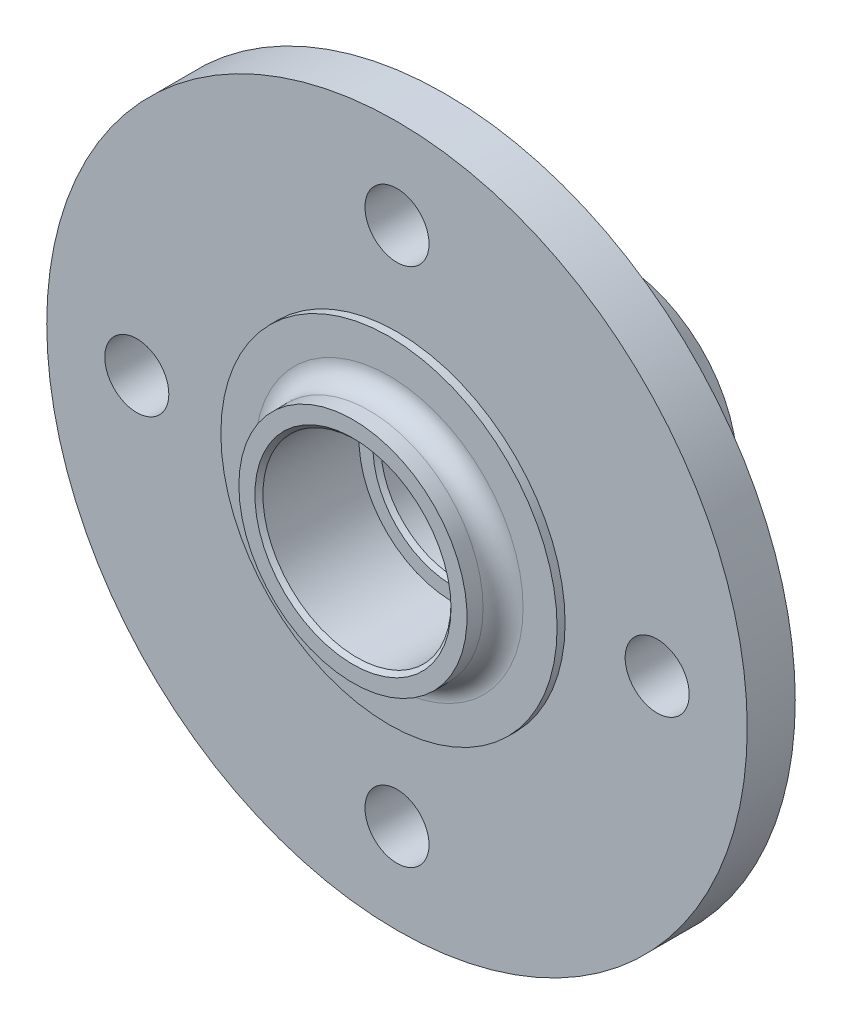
ISO-10303-21;
HEADER;
FILE_DESCRIPTION(('STEP AP214'),'2;1');
FILE_NAME('part.step','',(''),(''),'','','');
FILE_SCHEMA(('AUTOMOTIVE_DESIGN { 1 0 10303 214 1 1 1 1 }'));
ENDSEC;
DATA;
#1=APPLICATION_CONTEXT('core data for automotive mechanical design processes');
#2=APPLICATION_PROTOCOL_DEFINITION('international standard','automotive_design',2000,#1);
#3=PRODUCT_CONTEXT('',#1,'mechanical');
#4=PRODUCT('Part','Part','',(#3));
#5=PRODUCT_RELATED_PRODUCT_CATEGORY('part','',(#4));
#6=PRODUCT_DEFINITION_FORMATION('','',#4);
#7=PRODUCT_DEFINITION_CONTEXT('part definition',#1,'design');
#8=PRODUCT_DEFINITION('design','',#6,#7);
#9=PRODUCT_DEFINITION_SHAPE('','',#8);
#10=(LENGTH_UNIT() NAMED_UNIT(*) SI_UNIT(.MILLI.,.METRE.));
#11=(NAMED_UNIT(*) PLANE_ANGLE_UNIT() SI_UNIT($,.RADIAN.));
#12=(NAMED_UNIT(*) SI_UNIT($,.STERADIAN.) SOLID_ANGLE_UNIT());
#13=UNCERTAINTY_MEASURE_WITH_UNIT(LENGTH_MEASURE(1.E-05),#10,'distance_accuracy_value','');
#14=(GEOMETRIC_REPRESENTATION_CONTEXT(3) GLOBAL_UNCERTAINTY_ASSIGNED_CONTEXT((#13)) GLOBAL_UNIT_ASSIGNED_CONTEXT((#10,
#11,#12)) REPRESENTATION_CONTEXT('',''));
#15=CARTESIAN_POINT('',(0.,0.,0.));
#16=DIRECTION('',(0.,0.,1.));
#17=DIRECTION('',(1.,0.,0.));
#18=AXIS2_PLACEMENT_3D('',#15,#16,#17);
#19=CARTESIAN_POINT('',(0.,0.,-12.));
#20=DIRECTION('',(0.,0.,1.));
#21=DIRECTION('',(1.,0.,0.));
#22=AXIS2_PLACEMENT_3D('',#19,#20,#21);
#23=PLANE('',#22);
#24=CARTESIAN_POINT('',(0.,0.,-12.));
#25=DIRECTION('',(0.,0.,1.));
#26=DIRECTION('',(1.,0.,0.));
#27=AXIS2_PLACEMENT_3D('',#24,#25,#26);
#28=CIRCLE('',#27,44.5813448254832);
#29=CARTESIAN_POINT('',(44.5813448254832,0.,-12.));
#30=VERTEX_POINT('',#29);
#31=EDGE_CURVE('E61',#30,#30,#28,.T.);
#32=ORIENTED_EDGE('',*,*,#31,.T.);
#33=EDGE_LOOP('',(#32));
#34=FACE_BOUND('',#33,.T.);
#35=CARTESIAN_POINT('',(0.,0.,-12.));
#36=DIRECTION('',(0.,0.,1.));
#37=DIRECTION('',(1.,0.,0.));
#38=AXIS2_PLACEMENT_3D('',#35,#36,#37);
#39=CIRCLE('',#38,87.5);
#40=CARTESIAN_POINT('',(87.5,0.,-12.));
#41=VERTEX_POINT('',#40);
#42=EDGE_CURVE('E73',#41,#41,#39,.T.);
#43=ORIENTED_EDGE('',*,*,#42,.F.);
#44=EDGE_LOOP('',(#43));
#45=FACE_BOUND('',#44,.T.);
#46=CARTESIAN_POINT('',(0.,65.,-12.));
#47=DIRECTION('',(0.,0.,1.));
#48=DIRECTION('',(1.,0.,0.));
#49=AXIS2_PLACEMENT_3D('',#46,#47,#48);
#50=CIRCLE('',#49,8.00000000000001);
#51=CARTESIAN_POINT('',(8.00000000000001,65.,-12.));
#52=VERTEX_POINT('',#51);
#53=EDGE_CURVE('E79',#52,#52,#50,.T.);
#54=ORIENTED_EDGE('',*,*,#53,.T.);
#55=EDGE_LOOP('',(#54));
#56=FACE_BOUND('',#55,.T.);
#57=CARTESIAN_POINT('',(65.,0.,-12.));
#58=DIRECTION('',(0.,0.,1.));
#59=DIRECTION('',(1.,0.,0.));
#60=AXIS2_PLACEMENT_3D('',#57,#58,#59);
#61=CIRCLE('',#60,8.00000000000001);
#62=CARTESIAN_POINT('',(73.,0.,-12.));
#63=VERTEX_POINT('',#62);
#64=EDGE_CURVE('E85',#63,#63,#61,.T.);
#65=ORIENTED_EDGE('',*,*,#64,.T.);
#66=EDGE_LOOP('',(#65));
#67=FACE_BOUND('',#66,.T.);
#68=CARTESIAN_POINT('',(0.,-65.,-12.));
#69=DIRECTION('',(0.,0.,1.));
#70=DIRECTION('',(1.,0.,0.));
#71=AXIS2_PLACEMENT_3D('',#68,#69,#70);
#72=CIRCLE('',#71,8.);
#73=CARTESIAN_POINT('',(8.,-65.,-12.));
#74=VERTEX_POINT('',#73);
#75=EDGE_CURVE('E91',#74,#74,#72,.T.);
#76=ORIENTED_EDGE('',*,*,#75,.T.);
#77=EDGE_LOOP('',(#76));
#78=FACE_BOUND('',#77,.T.);
#79=CARTESIAN_POINT('',(-65.,0.,-12.));
#80=DIRECTION('',(0.,0.,1.));
#81=DIRECTION('',(1.,0.,0.));
#82=AXIS2_PLACEMENT_3D('',#79,#80,#81);
#83=CIRCLE('',#82,8.00000000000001);
#84=CARTESIAN_POINT('',(-57.,0.,-12.));
#85=VERTEX_POINT('',#84);
#86=EDGE_CURVE('E97',#85,#85,#83,.T.);
#87=ORIENTED_EDGE('',*,*,#86,.T.);
#88=EDGE_LOOP('',(#87));
#89=FACE_BOUND('',#88,.T.);
#90=ADVANCED_FACE('F29',(#34,#45,#56,#67,#78,#89),#23,.F.);
#91=CARTESIAN_POINT('',(0.,0.,2.));
#92=DIRECTION('',(0.,0.,1.));
#93=DIRECTION('',(1.,0.,0.));
#94=AXIS2_PLACEMENT_3D('',#91,#92,#93);
#95=PLANE('',#94);
#96=CARTESIAN_POINT('',(0.,0.,2.));
#97=DIRECTION('',(0.,0.,1.));
#98=DIRECTION('',(1.,0.,0.));
#99=AXIS2_PLACEMENT_3D('',#96,#97,#98);
#100=CIRCLE('',#99,33.5);
#101=CARTESIAN_POINT('',(33.5,0.,2.));
#102=VERTEX_POINT('',#101);
#103=EDGE_CURVE('E67',#102,#102,#100,.F.);
#104=ORIENTED_EDGE('',*,*,#103,.T.);
#105=EDGE_LOOP('',(#104));
#106=FACE_BOUND('',#105,.T.);
#107=CARTESIAN_POINT('',(0.,0.,2.));
#108=DIRECTION('',(0.,0.,1.));
#109=DIRECTION('',(1.,0.,0.));
#110=AXIS2_PLACEMENT_3D('',#107,#108,#109);
#111=CIRCLE('',#110,42.);
#112=CARTESIAN_POINT('',(-42.,0.,2.));
#113=VERTEX_POINT('',#112);
#114=EDGE_CURVE('E103',#113,#113,#111,.T.);
#115=ORIENTED_EDGE('',*,*,#114,.T.);
#116=EDGE_LOOP('',(#115));
#117=FACE_BOUND('',#116,.T.);
#118=ADVANCED_FACE('F142',(#106,#117),#95,.T.);
#119=CARTESIAN_POINT('',(0.,0.,0.));
#120=DIRECTION('',(0.,0.,1.));
#121=DIRECTION('',(1.,0.,0.));
#122=AXIS2_PLACEMENT_3D('',#119,#120,#121);
#123=PLANE('',#122);
#124=CARTESIAN_POINT('',(0.,0.,0.));
#125=DIRECTION('',(0.,0.,1.));
#126=DIRECTION('',(1.,0.,0.));
#127=AXIS2_PLACEMENT_3D('',#124,#125,#126);
#128=CIRCLE('',#127,87.5);
#129=CARTESIAN_POINT('',(87.5,0.,0.));
#130=VERTEX_POINT('',#129);
#131=EDGE_CURVE('E76',#130,#130,#128,.T.);
#132=ORIENTED_EDGE('',*,*,#131,.T.);
#133=EDGE_LOOP('',(#132));
#134=FACE_BOUND('',#133,.T.);
#135=CARTESIAN_POINT('',(0.,65.,0.));
#136=DIRECTION('',(0.,0.,1.));
#137=DIRECTION('',(1.,0.,0.));
#138=AXIS2_PLACEMENT_3D('',#135,#136,#137);
#139=CIRCLE('',#138,8.00000000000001);
#140=CARTESIAN_POINT('',(8.00000000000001,65.,0.));
#141=VERTEX_POINT('',#140);
#142=EDGE_CURVE('E82',#141,#141,#139,.T.);
#143=ORIENTED_EDGE('',*,*,#142,.F.);
#144=EDGE_LOOP('',(#143));
#145=FACE_BOUND('',#144,.T.);
#146=CARTESIAN_POINT('',(65.,0.,0.));
#147=DIRECTION('',(0.,0.,1.));
#148=DIRECTION('',(1.,0.,0.));
#149=AXIS2_PLACEMENT_3D('',#146,#147,#148);
#150=CIRCLE('',#149,8.00000000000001);
#151=CARTESIAN_POINT('',(73.,0.,0.));
#152=VERTEX_POINT('',#151);
#153=EDGE_CURVE('E88',#152,#152,#150,.T.);
#154=ORIENTED_EDGE('',*,*,#153,.F.);
#155=EDGE_LOOP('',(#154));
#156=FACE_BOUND('',#155,.T.);
#157=CARTESIAN_POINT('',(0.,-65.,0.));
#158=DIRECTION('',(0.,0.,1.));
#159=DIRECTION('',(1.,0.,0.));
#160=AXIS2_PLACEMENT_3D('',#157,#158,#159);
#161=CIRCLE('',#160,8.);
#162=CARTESIAN_POINT('',(8.,-65.,0.));
#163=VERTEX_POINT('',#162);
#164=EDGE_CURVE('E94',#163,#163,#161,.T.);
#165=ORIENTED_EDGE('',*,*,#164,.F.);
#166=EDGE_LOOP('',(#165));
#167=FACE_BOUND('',#166,.T.);
#168=CARTESIAN_POINT('',(-65.,0.,0.));
#169=DIRECTION('',(0.,0.,1.));
#170=DIRECTION('',(1.,0.,0.));
#171=AXIS2_PLACEMENT_3D('',#168,#169,#170);
#172=CIRCLE('',#171,8.00000000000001);
#173=CARTESIAN_POINT('',(-57.,0.,0.));
#174=VERTEX_POINT('',#173);
#175=EDGE_CURVE('E100',#174,#174,#172,.T.);
#176=ORIENTED_EDGE('',*,*,#175,.F.);
#177=EDGE_LOOP('',(#176));
#178=FACE_BOUND('',#177,.T.);
#179=CARTESIAN_POINT('',(0.,0.,0.));
#180=DIRECTION('',(0.,0.,1.));
#181=DIRECTION('',(1.,0.,0.));
#182=AXIS2_PLACEMENT_3D('',#179,#180,#181);
#183=CIRCLE('',#182,42.);
#184=CARTESIAN_POINT('',(-42.,0.,0.));
#185=VERTEX_POINT('',#184);
#186=EDGE_CURVE('E106',#185,#185,#183,.T.);
#187=ORIENTED_EDGE('',*,*,#186,.F.);
#188=EDGE_LOOP('',(#187));
#189=FACE_BOUND('',#188,.T.);
#190=ADVANCED_FACE('F147',(#134,#145,#156,#167,#178,#189),#123,.T.);
#191=CARTESIAN_POINT('',(0.,0.,-12.));
#192=DIRECTION('',(0.,0.,1.));
#193=DIRECTION('',(1.,0.,0.));
#194=AXIS2_PLACEMENT_3D('',#191,#192,#193);
#195=CYLINDRICAL_SURFACE('',#194,87.5);
#196=CARTESIAN_POINT('',(87.5,0.,-12.));
#197=CARTESIAN_POINT('',(87.5,0.,-11.875));
#198=CARTESIAN_POINT('',(87.5,0.,-11.75));
#199=CARTESIAN_POINT('',(87.5,0.,-11.5));
#200=CARTESIAN_POINT('',(87.5,0.,-11.375));
#201=CARTESIAN_POINT('',(87.5,0.,-11.125));
#202=CARTESIAN_POINT('',(87.5,0.,-11.));
#203=CARTESIAN_POINT('',(87.5,0.,-10.75));
#204=CARTESIAN_POINT('',(87.5,0.,-10.625));
#205=CARTESIAN_POINT('',(87.5,0.,-10.375));
#206=CARTESIAN_POINT('',(87.5,0.,-10.25));
#207=CARTESIAN_POINT('',(87.5,0.,-10.));
#208=CARTESIAN_POINT('',(87.5,0.,-9.875));
#209=CARTESIAN_POINT('',(87.5,0.,-9.625));
#210=CARTESIAN_POINT('',(87.5,0.,-9.5));
#211=CARTESIAN_POINT('',(87.5,0.,-9.25));
#212=CARTESIAN_POINT('',(87.5,0.,-9.125));
#213=CARTESIAN_POINT('',(87.5,0.,-8.875));
#214=CARTESIAN_POINT('',(87.5,0.,-8.75));
#215=CARTESIAN_POINT('',(87.5,0.,-8.5));
#216=CARTESIAN_POINT('',(87.5,0.,-8.375));
#217=CARTESIAN_POINT('',(87.5,0.,-8.125));
#218=CARTESIAN_POINT('',(87.5,0.,-8.));
#219=CARTESIAN_POINT('',(87.5,0.,-7.75));
#220=CARTESIAN_POINT('',(87.5,0.,-7.625));
#221=CARTESIAN_POINT('',(87.5,0.,-7.375));
#222=CARTESIAN_POINT('',(87.5,0.,-7.25));
#223=CARTESIAN_POINT('',(87.5,0.,-7.));
#224=CARTESIAN_POINT('',(87.5,0.,-6.875));
#225=CARTESIAN_POINT('',(87.5,0.,-6.625));
#226=CARTESIAN_POINT('',(87.5,0.,-6.5));
#227=CARTESIAN_POINT('',(87.5,0.,-6.25));
#228=CARTESIAN_POINT('',(87.5,0.,-6.125));
#229=CARTESIAN_POINT('',(87.5,0.,-5.875));
#230=CARTESIAN_POINT('',(87.5,0.,-5.75));
#231=CARTESIAN_POINT('',(87.5,0.,-5.5));
#232=CARTESIAN_POINT('',(87.5,0.,-5.375));
#233=CARTESIAN_POINT('',(87.5,0.,-5.125));
#234=CARTESIAN_POINT('',(87.5,0.,-5.));
#235=CARTESIAN_POINT('',(87.5,0.,-4.75));
#236=CARTESIAN_POINT('',(87.5,0.,-4.625));
#237=CARTESIAN_POINT('',(87.5,0.,-4.375));
#238=CARTESIAN_POINT('',(87.5,0.,-4.25));
#239=CARTESIAN_POINT('',(87.5,0.,-4.));
#240=CARTESIAN_POINT('',(87.5,0.,-3.875));
#241=CARTESIAN_POINT('',(87.5,0.,-3.625));
#242=CARTESIAN_POINT('',(87.5,0.,-3.5));
#243=CARTESIAN_POINT('',(87.5,0.,-3.25));
#244=CARTESIAN_POINT('',(87.5,0.,-3.125));
#245=CARTESIAN_POINT('',(87.5,0.,-2.875));
#246=CARTESIAN_POINT('',(87.5,0.,-2.75));
#247=CARTESIAN_POINT('',(87.5,0.,-2.5));
#248=CARTESIAN_POINT('',(87.5,0.,-2.375));
#249=CARTESIAN_POINT('',(87.5,0.,-2.125));
#250=CARTESIAN_POINT('',(87.5,0.,-2.));
#251=CARTESIAN_POINT('',(87.5,0.,-1.75));
#252=CARTESIAN_POINT('',(87.5,0.,-1.625));
#253=CARTESIAN_POINT('',(87.5,0.,-1.375));
#254=CARTESIAN_POINT('',(87.5,0.,-1.25));
#255=CARTESIAN_POINT('',(87.5,0.,-1.));
#256=CARTESIAN_POINT('',(87.5,0.,-0.875000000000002));
#257=CARTESIAN_POINT('',(87.5,0.,-0.625000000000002));
#258=CARTESIAN_POINT('',(87.5,0.,-0.500000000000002));
#259=CARTESIAN_POINT('',(87.5,0.,-0.250000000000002));
#260=CARTESIAN_POINT('',(87.5,0.,-0.125000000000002));
#261=CARTESIAN_POINT('',(87.5,0.,0.));
#262=B_SPLINE_CURVE_WITH_KNOTS('',3,(#196,#197,#198,#199,#200,#201,#202,#203,#204,#205,#206,
#207,#208,#209,#210,#211,#212,#213,#214,#215,#216,#217,#218,#219,#220,#221,#222,#223,#224,#225,
#226,#227,#228,#229,#230,#231,#232,#233,#234,#235,#236,#237,#238,#239,#240,#241,#242,#243,#244,
#245,#246,#247,#248,#249,#250,#251,#252,#253,#254,#255,#256,#257,#258,#259,#260,#261),
.UNSPECIFIED.,.F.,.F.,(4,2,2,2,2,2,2,2,2,2,2,2,2,2,2,2,2,2,2,2,2,2,2,2,2,2,2,2,2,2,2,2,4),(0.,
0.374999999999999,0.749999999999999,1.125,1.5,1.875,2.25,2.625,3.,3.375,3.75,4.125,4.5,4.875,
5.25,5.625,6.,6.375,6.75,7.125,7.5,7.875,8.25,8.625,9.,9.375,9.75,10.125,10.5,10.875,11.25,
11.625,12.),.UNSPECIFIED.);
#263=EDGE_CURVE('BSEAM31',#41,#130,#262,.T.);
#264=ORIENTED_EDGE('',*,*,#42,.T.);
#265=ORIENTED_EDGE('',*,*,#131,.F.);
#266=ORIENTED_EDGE('',*,*,#263,.T.);
#267=ORIENTED_EDGE('',*,*,#263,.F.);
#268=EDGE_LOOP('',(#264,#266,#265,#267));
#269=FACE_BOUND('',#268,.T.);
#270=ADVANCED_FACE('F31',(#269),#195,.T.);
#271=CARTESIAN_POINT('',(0.,65.,-12.));
#272=DIRECTION('',(0.,0.,1.));
#273=DIRECTION('',(1.,0.,0.));
#274=AXIS2_PLACEMENT_3D('',#271,#272,#273);
#275=CYLINDRICAL_SURFACE('',#274,8.00000000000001);
#276=CARTESIAN_POINT('',(8.00000000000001,65.,-12.));
#277=CARTESIAN_POINT('',(8.00000000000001,65.,-11.875));
#278=CARTESIAN_POINT('',(8.00000000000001,65.,-11.75));
#279=CARTESIAN_POINT('',(8.00000000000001,65.,-11.5));
#280=CARTESIAN_POINT('',(8.00000000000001,65.,-11.375));
#281=CARTESIAN_POINT('',(8.00000000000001,65.,-11.125));
#282=CARTESIAN_POINT('',(8.00000000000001,65.,-11.));
#283=CARTESIAN_POINT('',(8.00000000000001,65.,-10.75));
#284=CARTESIAN_POINT('',(8.00000000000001,65.,-10.625));
#285=CARTESIAN_POINT('',(8.00000000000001,65.,-10.375));
#286=CARTESIAN_POINT('',(8.00000000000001,65.,-10.25));
#287=CARTESIAN_POINT('',(8.00000000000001,65.,-10.));
#288=CARTESIAN_POINT('',(8.00000000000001,65.,-9.875));
#289=CARTESIAN_POINT('',(8.00000000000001,65.,-9.625));
#290=CARTESIAN_POINT('',(8.00000000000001,65.,-9.5));
#291=CARTESIAN_POINT('',(8.00000000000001,65.,-9.25));
#292=CARTESIAN_POINT('',(8.00000000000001,65.,-9.125));
#293=CARTESIAN_POINT('',(8.00000000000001,65.,-8.875));
#294=CARTESIAN_POINT('',(8.00000000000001,65.,-8.75));
#295=CARTESIAN_POINT('',(8.00000000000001,65.,-8.5));
#296=CARTESIAN_POINT('',(8.00000000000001,65.,-8.375));
#297=CARTESIAN_POINT('',(8.00000000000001,65.,-8.125));
#298=CARTESIAN_POINT('',(8.00000000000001,65.,-8.));
#299=CARTESIAN_POINT('',(8.00000000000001,65.,-7.75));
#300=CARTESIAN_POINT('',(8.00000000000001,65.,-7.625));
#301=CARTESIAN_POINT('',(8.00000000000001,65.,-7.375));
#302=CARTESIAN_POINT('',(8.00000000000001,65.,-7.25));
#303=CARTESIAN_POINT('',(8.00000000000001,65.,-7.));
#304=CARTESIAN_POINT('',(8.00000000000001,65.,-6.875));
#305=CARTESIAN_POINT('',(8.00000000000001,65.,-6.625));
#306=CARTESIAN_POINT('',(8.00000000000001,65.,-6.5));
#307=CARTESIAN_POINT('',(8.00000000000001,65.,-6.25));
#308=CARTESIAN_POINT('',(8.00000000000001,65.,-6.125));
#309=CARTESIAN_POINT('',(8.00000000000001,65.,-5.875));
#310=CARTESIAN_POINT('',(8.00000000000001,65.,-5.75));
#311=CARTESIAN_POINT('',(8.00000000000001,65.,-5.5));
#312=CARTESIAN_POINT('',(8.00000000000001,65.,-5.375));
#313=CARTESIAN_POINT('',(8.00000000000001,65.,-5.125));
#314=CARTESIAN_POINT('',(8.00000000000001,65.,-5.));
#315=CARTESIAN_POINT('',(8.00000000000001,65.,-4.75));
#316=CARTESIAN_POINT('',(8.00000000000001,65.,-4.625));
#317=CARTESIAN_POINT('',(8.00000000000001,65.,-4.375));
#318=CARTESIAN_POINT('',(8.00000000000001,65.,-4.25));
#319=CARTESIAN_POINT('',(8.00000000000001,65.,-4.));
#320=CARTESIAN_POINT('',(8.00000000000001,65.,-3.875));
#321=CARTESIAN_POINT('',(8.00000000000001,65.,-3.625));
#322=CARTESIAN_POINT('',(8.00000000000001,65.,-3.5));
#323=CARTESIAN_POINT('',(8.00000000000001,65.,-3.25));
#324=CARTESIAN_POINT('',(8.00000000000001,65.,-3.125));
#325=CARTESIAN_POINT('',(8.00000000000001,65.,-2.875));
#326=CARTESIAN_POINT('',(8.00000000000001,65.,-2.75));
#327=CARTESIAN_POINT('',(8.00000000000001,65.,-2.5));
#328=CARTESIAN_POINT('',(8.00000000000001,65.,-2.375));
#329=CARTESIAN_POINT('',(8.00000000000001,65.,-2.125));
#330=CARTESIAN_POINT('',(8.00000000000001,65.,-2.));
#331=CARTESIAN_POINT('',(8.00000000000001,65.,-1.75));
#332=CARTESIAN_POINT('',(8.00000000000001,65.,-1.625));
#333=CARTESIAN_POINT('',(8.00000000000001,65.,-1.375));
#334=CARTESIAN_POINT('',(8.00000000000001,65.,-1.25));
#335=CARTESIAN_POINT('',(8.00000000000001,65.,-1.));
#336=CARTESIAN_POINT('',(8.00000000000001,65.,-0.875000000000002));
#337=CARTESIAN_POINT('',(8.00000000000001,65.,-0.625000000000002));
#338=CARTESIAN_POINT('',(8.00000000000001,65.,-0.500000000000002));
#339=CARTESIAN_POINT('',(8.00000000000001,65.,-0.250000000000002));
#340=CARTESIAN_POINT('',(8.00000000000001,65.,-0.125000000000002));
#341=CARTESIAN_POINT('',(8.00000000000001,65.,0.));
#342=B_SPLINE_CURVE_WITH_KNOTS('',3,(#276,#277,#278,#279,#280,#281,#282,#283,#284,#285,#286,
#287,#288,#289,#290,#291,#292,#293,#294,#295,#296,#297,#298,#299,#300,#301,#302,#303,#304,#305,
#306,#307,#308,#309,#310,#311,#312,#313,#314,#315,#316,#317,#318,#319,#320,#321,#322,#323,#324,
#325,#326,#327,#328,#329,#330,#331,#332,#333,#334,#335,#336,#337,#338,#339,#340,#341),
.UNSPECIFIED.,.F.,.F.,(4,2,2,2,2,2,2,2,2,2,2,2,2,2,2,2,2,2,2,2,2,2,2,2,2,2,2,2,2,2,2,2,4),(0.,
0.374999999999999,0.749999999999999,1.125,1.5,1.875,2.25,2.625,3.,3.375,3.75,4.125,4.5,4.875,
5.25,5.625,6.,6.375,6.75,7.125,7.5,7.875,8.25,8.625,9.,9.375,9.75,10.125,10.5,10.875,11.25,
11.625,12.),.UNSPECIFIED.);
#343=EDGE_CURVE('BSEAM155',#52,#141,#342,.T.);
#344=ORIENTED_EDGE('',*,*,#53,.F.);
#345=ORIENTED_EDGE('',*,*,#142,.T.);
#346=ORIENTED_EDGE('',*,*,#343,.T.);
#347=ORIENTED_EDGE('',*,*,#343,.F.);
#348=EDGE_LOOP('',(#344,#346,#345,#347));
#349=FACE_BOUND('',#348,.T.);
#350=ADVANCED_FACE('F155',(#349),#275,.F.);
#351=CARTESIAN_POINT('',(65.,0.,-12.));
#352=DIRECTION('',(0.,0.,1.));
#353=DIRECTION('',(1.,0.,0.));
#354=AXIS2_PLACEMENT_3D('',#351,#352,#353);
#355=CYLINDRICAL_SURFACE('',#354,8.00000000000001);
#356=CARTESIAN_POINT('',(73.,0.,-12.));
#357=CARTESIAN_POINT('',(73.,0.,-11.875));
#358=CARTESIAN_POINT('',(73.,0.,-11.75));
#359=CARTESIAN_POINT('',(73.,0.,-11.5));
#360=CARTESIAN_POINT('',(73.,0.,-11.375));
#361=CARTESIAN_POINT('',(73.,0.,-11.125));
#362=CARTESIAN_POINT('',(73.,0.,-11.));
#363=CARTESIAN_POINT('',(73.,0.,-10.75));
#364=CARTESIAN_POINT('',(73.,0.,-10.625));
#365=CARTESIAN_POINT('',(73.,0.,-10.375));
#366=CARTESIAN_POINT('',(73.,0.,-10.25));
#367=CARTESIAN_POINT('',(73.,0.,-10.));
#368=CARTESIAN_POINT('',(73.,0.,-9.875));
#369=CARTESIAN_POINT('',(73.,0.,-9.625));
#370=CARTESIAN_POINT('',(73.,0.,-9.5));
#371=CARTESIAN_POINT('',(73.,0.,-9.25));
#372=CARTESIAN_POINT('',(73.,0.,-9.125));
#373=CARTESIAN_POINT('',(73.,0.,-8.875));
#374=CARTESIAN_POINT('',(73.,0.,-8.75));
#375=CARTESIAN_POINT('',(73.,0.,-8.5));
#376=CARTESIAN_POINT('',(73.,0.,-8.375));
#377=CARTESIAN_POINT('',(73.,0.,-8.125));
#378=CARTESIAN_POINT('',(73.,0.,-8.));
#379=CARTESIAN_POINT('',(73.,0.,-7.75));
#380=CARTESIAN_POINT('',(73.,0.,-7.625));
#381=CARTESIAN_POINT('',(73.,0.,-7.375));
#382=CARTESIAN_POINT('',(73.,0.,-7.25));
#383=CARTESIAN_POINT('',(73.,0.,-7.));
#384=CARTESIAN_POINT('',(73.,0.,-6.875));
#385=CARTESIAN_POINT('',(73.,0.,-6.625));
#386=CARTESIAN_POINT('',(73.,0.,-6.5));
#387=CARTESIAN_POINT('',(73.,0.,-6.25));
#388=CARTESIAN_POINT('',(73.,0.,-6.125));
#389=CARTESIAN_POINT('',(73.,0.,-5.875));
#390=CARTESIAN_POINT('',(73.,0.,-5.75));
#391=CARTESIAN_POINT('',(73.,0.,-5.5));
#392=CARTESIAN_POINT('',(73.,0.,-5.375));
#393=CARTESIAN_POINT('',(73.,0.,-5.125));
#394=CARTESIAN_POINT('',(73.,0.,-5.));
#395=CARTESIAN_POINT('',(73.,0.,-4.75));
#396=CARTESIAN_POINT('',(73.,0.,-4.625));
#397=CARTESIAN_POINT('',(73.,0.,-4.375));
#398=CARTESIAN_POINT('',(73.,0.,-4.25));
#399=CARTESIAN_POINT('',(73.,0.,-4.));
#400=CARTESIAN_POINT('',(73.,0.,-3.875));
#401=CARTESIAN_POINT('',(73.,0.,-3.625));
#402=CARTESIAN_POINT('',(73.,0.,-3.5));
#403=CARTESIAN_POINT('',(73.,0.,-3.25));
#404=CARTESIAN_POINT('',(73.,0.,-3.125));
#405=CARTESIAN_POINT('',(73.,0.,-2.875));
#406=CARTESIAN_POINT('',(73.,0.,-2.75));
#407=CARTESIAN_POINT('',(73.,0.,-2.5));
#408=CARTESIAN_POINT('',(73.,0.,-2.375));
#409=CARTESIAN_POINT('',(73.,0.,-2.125));
#410=CARTESIAN_POINT('',(73.,0.,-2.));
#411=CARTESIAN_POINT('',(73.,0.,-1.75));
#412=CARTESIAN_POINT('',(73.,0.,-1.625));
#413=CARTESIAN_POINT('',(73.,0.,-1.375));
#414=CARTESIAN_POINT('',(73.,0.,-1.25));
#415=CARTESIAN_POINT('',(73.,0.,-1.));
#416=CARTESIAN_POINT('',(73.,0.,-0.875000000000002));
#417=CARTESIAN_POINT('',(73.,0.,-0.625000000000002));
#418=CARTESIAN_POINT('',(73.,0.,-0.500000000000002));
#419=CARTESIAN_POINT('',(73.,0.,-0.250000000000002));
#420=CARTESIAN_POINT('',(73.,0.,-0.125000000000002));
#421=CARTESIAN_POINT('',(73.,0.,0.));
#422=B_SPLINE_CURVE_WITH_KNOTS('',3,(#356,#357,#358,#359,#360,#361,#362,#363,#364,#365,#366,
#367,#368,#369,#370,#371,#372,#373,#374,#375,#376,#377,#378,#379,#380,#381,#382,#383,#384,#385,
#386,#387,#388,#389,#390,#391,#392,#393,#394,#395,#396,#397,#398,#399,#400,#401,#402,#403,#404,
#405,#406,#407,#408,#409,#410,#411,#412,#413,#414,#415,#416,#417,#418,#419,#420,#421),
.UNSPECIFIED.,.F.,.F.,(4,2,2,2,2,2,2,2,2,2,2,2,2,2,2,2,2,2,2,2,2,2,2,2,2,2,2,2,2,2,2,2,4),(0.,
0.374999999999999,0.749999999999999,1.125,1.5,1.875,2.25,2.625,3.,3.375,3.75,4.125,4.5,4.875,
5.25,5.625,6.,6.375,6.75,7.125,7.5,7.875,8.25,8.625,9.,9.375,9.75,10.125,10.5,10.875,11.25,
11.625,12.),.UNSPECIFIED.);
#423=EDGE_CURVE('BSEAM158',#63,#152,#422,.T.);
#424=ORIENTED_EDGE('',*,*,#64,.F.);
#425=ORIENTED_EDGE('',*,*,#153,.T.);
#426=ORIENTED_EDGE('',*,*,#423,.T.);
#427=ORIENTED_EDGE('',*,*,#423,.F.);
#428=EDGE_LOOP('',(#424,#426,#425,#427));
#429=FACE_BOUND('',#428,.T.);
#430=ADVANCED_FACE('F158',(#429),#355,.F.);
#431=CARTESIAN_POINT('',(0.,-65.,-12.));
#432=DIRECTION('',(0.,0.,1.));
#433=DIRECTION('',(1.,0.,0.));
#434=AXIS2_PLACEMENT_3D('',#431,#432,#433);
#435=CYLINDRICAL_SURFACE('',#434,8.);
#436=CARTESIAN_POINT('',(8.,-65.,-12.));
#437=CARTESIAN_POINT('',(8.,-65.,-11.875));
#438=CARTESIAN_POINT('',(8.,-65.,-11.75));
#439=CARTESIAN_POINT('',(8.,-65.,-11.5));
#440=CARTESIAN_POINT('',(8.,-65.,-11.375));
#441=CARTESIAN_POINT('',(8.,-65.,-11.125));
#442=CARTESIAN_POINT('',(8.,-65.,-11.));
#443=CARTESIAN_POINT('',(8.,-65.,-10.75));
#444=CARTESIAN_POINT('',(8.,-65.,-10.625));
#445=CARTESIAN_POINT('',(8.,-65.,-10.375));
#446=CARTESIAN_POINT('',(8.,-65.,-10.25));
#447=CARTESIAN_POINT('',(8.,-65.,-10.));
#448=CARTESIAN_POINT('',(8.,-65.,-9.875));
#449=CARTESIAN_POINT('',(8.,-65.,-9.625));
#450=CARTESIAN_POINT('',(8.,-65.,-9.5));
#451=CARTESIAN_POINT('',(8.,-65.,-9.25));
#452=CARTESIAN_POINT('',(8.,-65.,-9.125));
#453=CARTESIAN_POINT('',(8.,-65.,-8.875));
#454=CARTESIAN_POINT('',(8.,-65.,-8.75));
#455=CARTESIAN_POINT('',(8.,-65.,-8.5));
#456=CARTESIAN_POINT('',(8.,-65.,-8.375));
#457=CARTESIAN_POINT('',(8.,-65.,-8.125));
#458=CARTESIAN_POINT('',(8.,-65.,-8.));
#459=CARTESIAN_POINT('',(8.,-65.,-7.75));
#460=CARTESIAN_POINT('',(8.,-65.,-7.625));
#461=CARTESIAN_POINT('',(8.,-65.,-7.375));
#462=CARTESIAN_POINT('',(8.,-65.,-7.25));
#463=CARTESIAN_POINT('',(8.,-65.,-7.));
#464=CARTESIAN_POINT('',(8.,-65.,-6.875));
#465=CARTESIAN_POINT('',(8.,-65.,-6.625));
#466=CARTESIAN_POINT('',(8.,-65.,-6.5));
#467=CARTESIAN_POINT('',(8.,-65.,-6.25));
#468=CARTESIAN_POINT('',(8.,-65.,-6.125));
#469=CARTESIAN_POINT('',(8.,-65.,-5.875));
#470=CARTESIAN_POINT('',(8.,-65.,-5.75));
#471=CARTESIAN_POINT('',(8.,-65.,-5.5));
#472=CARTESIAN_POINT('',(8.,-65.,-5.375));
#473=CARTESIAN_POINT('',(8.,-65.,-5.125));
#474=CARTESIAN_POINT('',(8.,-65.,-5.));
#475=CARTESIAN_POINT('',(8.,-65.,-4.75));
#476=CARTESIAN_POINT('',(8.,-65.,-4.625));
#477=CARTESIAN_POINT('',(8.,-65.,-4.375));
#478=CARTESIAN_POINT('',(8.,-65.,-4.25));
#479=CARTESIAN_POINT('',(8.,-65.,-4.));
#480=CARTESIAN_POINT('',(8.,-65.,-3.875));
#481=CARTESIAN_POINT('',(8.,-65.,-3.625));
#482=CARTESIAN_POINT('',(8.,-65.,-3.5));
#483=CARTESIAN_POINT('',(8.,-65.,-3.25));
#484=CARTESIAN_POINT('',(8.,-65.,-3.125));
#485=CARTESIAN_POINT('',(8.,-65.,-2.875));
#486=CARTESIAN_POINT('',(8.,-65.,-2.75));
#487=CARTESIAN_POINT('',(8.,-65.,-2.5));
#488=CARTESIAN_POINT('',(8.,-65.,-2.375));
#489=CARTESIAN_POINT('',(8.,-65.,-2.125));
#490=CARTESIAN_POINT('',(8.,-65.,-2.));
#491=CARTESIAN_POINT('',(8.,-65.,-1.75));
#492=CARTESIAN_POINT('',(8.,-65.,-1.625));
#493=CARTESIAN_POINT('',(8.,-65.,-1.375));
#494=CARTESIAN_POINT('',(8.,-65.,-1.25));
#495=CARTESIAN_POINT('',(8.,-65.,-1.));
#496=CARTESIAN_POINT('',(8.,-65.,-0.875000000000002));
#497=CARTESIAN_POINT('',(8.,-65.,-0.625000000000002));
#498=CARTESIAN_POINT('',(8.,-65.,-0.500000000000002));
#499=CARTESIAN_POINT('',(8.,-65.,-0.250000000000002));
#500=CARTESIAN_POINT('',(8.,-65.,-0.125000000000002));
#501=CARTESIAN_POINT('',(8.,-65.,0.));
#502=B_SPLINE_CURVE_WITH_KNOTS('',3,(#436,#437,#438,#439,#440,#441,#442,#443,#444,#445,#446,
#447,#448,#449,#450,#451,#452,#453,#454,#455,#456,#457,#458,#459,#460,#461,#462,#463,#464,#465,
#466,#467,#468,#469,#470,#471,#472,#473,#474,#475,#476,#477,#478,#479,#480,#481,#482,#483,#484,
#485,#486,#487,#488,#489,#490,#491,#492,#493,#494,#495,#496,#497,#498,#499,#500,#501),
.UNSPECIFIED.,.F.,.F.,(4,2,2,2,2,2,2,2,2,2,2,2,2,2,2,2,2,2,2,2,2,2,2,2,2,2,2,2,2,2,2,2,4),(0.,
0.374999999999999,0.749999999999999,1.125,1.5,1.875,2.25,2.625,3.,3.375,3.75,4.125,4.5,4.875,
5.25,5.625,6.,6.375,6.75,7.125,7.5,7.875,8.25,8.625,9.,9.375,9.75,10.125,10.5,10.875,11.25,
11.625,12.),.UNSPECIFIED.);
#503=EDGE_CURVE('BSEAM162',#74,#163,#502,.T.);
#504=ORIENTED_EDGE('',*,*,#75,.F.);
#505=ORIENTED_EDGE('',*,*,#164,.T.);
#506=ORIENTED_EDGE('',*,*,#503,.T.);
#507=ORIENTED_EDGE('',*,*,#503,.F.);
#508=EDGE_LOOP('',(#504,#506,#505,#507));
#509=FACE_BOUND('',#508,.T.);
#510=ADVANCED_FACE('F162',(#509),#435,.F.);
#511=CARTESIAN_POINT('',(-65.,0.,-12.));
#512=DIRECTION('',(0.,0.,1.));
#513=DIRECTION('',(1.,0.,0.));
#514=AXIS2_PLACEMENT_3D('',#511,#512,#513);
#515=CYLINDRICAL_SURFACE('',#514,8.00000000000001);
#516=CARTESIAN_POINT('',(-57.,0.,-12.));
#517=CARTESIAN_POINT('',(-57.,0.,-11.875));
#518=CARTESIAN_POINT('',(-57.,0.,-11.75));
#519=CARTESIAN_POINT('',(-57.,0.,-11.5));
#520=CARTESIAN_POINT('',(-57.,0.,-11.375));
#521=CARTESIAN_POINT('',(-57.,0.,-11.125));
#522=CARTESIAN_POINT('',(-57.,0.,-11.));
#523=CARTESIAN_POINT('',(-57.,0.,-10.75));
#524=CARTESIAN_POINT('',(-57.,0.,-10.625));
#525=CARTESIAN_POINT('',(-57.,0.,-10.375));
#526=CARTESIAN_POINT('',(-57.,0.,-10.25));
#527=CARTESIAN_POINT('',(-57.,0.,-10.));
#528=CARTESIAN_POINT('',(-57.,0.,-9.875));
#529=CARTESIAN_POINT('',(-57.,0.,-9.625));
#530=CARTESIAN_POINT('',(-57.,0.,-9.5));
#531=CARTESIAN_POINT('',(-57.,0.,-9.25));
#532=CARTESIAN_POINT('',(-57.,0.,-9.125));
#533=CARTESIAN_POINT('',(-57.,0.,-8.875));
#534=CARTESIAN_POINT('',(-57.,0.,-8.75));
#535=CARTESIAN_POINT('',(-57.,0.,-8.5));
#536=CARTESIAN_POINT('',(-57.,0.,-8.375));
#537=CARTESIAN_POINT('',(-57.,0.,-8.125));
#538=CARTESIAN_POINT('',(-57.,0.,-8.));
#539=CARTESIAN_POINT('',(-57.,0.,-7.75));
#540=CARTESIAN_POINT('',(-57.,0.,-7.625));
#541=CARTESIAN_POINT('',(-57.,0.,-7.375));
#542=CARTESIAN_POINT('',(-57.,0.,-7.25));
#543=CARTESIAN_POINT('',(-57.,0.,-7.));
#544=CARTESIAN_POINT('',(-57.,0.,-6.875));
#545=CARTESIAN_POINT('',(-57.,0.,-6.625));
#546=CARTESIAN_POINT('',(-57.,0.,-6.5));
#547=CARTESIAN_POINT('',(-57.,0.,-6.25));
#548=CARTESIAN_POINT('',(-57.,0.,-6.125));
#549=CARTESIAN_POINT('',(-57.,0.,-5.875));
#550=CARTESIAN_POINT('',(-57.,0.,-5.75));
#551=CARTESIAN_POINT('',(-57.,0.,-5.5));
#552=CARTESIAN_POINT('',(-57.,0.,-5.375));
#553=CARTESIAN_POINT('',(-57.,0.,-5.125));
#554=CARTESIAN_POINT('',(-57.,0.,-5.));
#555=CARTESIAN_POINT('',(-57.,0.,-4.75));
#556=CARTESIAN_POINT('',(-57.,0.,-4.625));
#557=CARTESIAN_POINT('',(-57.,0.,-4.375));
#558=CARTESIAN_POINT('',(-57.,0.,-4.25));
#559=CARTESIAN_POINT('',(-57.,0.,-4.));
#560=CARTESIAN_POINT('',(-57.,0.,-3.875));
#561=CARTESIAN_POINT('',(-57.,0.,-3.625));
#562=CARTESIAN_POINT('',(-57.,0.,-3.5));
#563=CARTESIAN_POINT('',(-57.,0.,-3.25));
#564=CARTESIAN_POINT('',(-57.,0.,-3.125));
#565=CARTESIAN_POINT('',(-57.,0.,-2.875));
#566=CARTESIAN_POINT('',(-57.,0.,-2.75));
#567=CARTESIAN_POINT('',(-57.,0.,-2.5));
#568=CARTESIAN_POINT('',(-57.,0.,-2.375));
#569=CARTESIAN_POINT('',(-57.,0.,-2.125));
#570=CARTESIAN_POINT('',(-57.,0.,-2.));
#571=CARTESIAN_POINT('',(-57.,0.,-1.75));
#572=CARTESIAN_POINT('',(-57.,0.,-1.625));
#573=CARTESIAN_POINT('',(-57.,0.,-1.375));
#574=CARTESIAN_POINT('',(-57.,0.,-1.25));
#575=CARTESIAN_POINT('',(-57.,0.,-1.));
#576=CARTESIAN_POINT('',(-57.,0.,-0.875000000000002));
#577=CARTESIAN_POINT('',(-57.,0.,-0.625000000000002));
#578=CARTESIAN_POINT('',(-57.,0.,-0.500000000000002));
#579=CARTESIAN_POINT('',(-57.,0.,-0.250000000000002));
#580=CARTESIAN_POINT('',(-57.,0.,-0.125000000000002));
#581=CARTESIAN_POINT('',(-57.,0.,0.));
#582=B_SPLINE_CURVE_WITH_KNOTS('',3,(#516,#517,#518,#519,#520,#521,#522,#523,#524,#525,#526,
#527,#528,#529,#530,#531,#532,#533,#534,#535,#536,#537,#538,#539,#540,#541,#542,#543,#544,#545,
#546,#547,#548,#549,#550,#551,#552,#553,#554,#555,#556,#557,#558,#559,#560,#561,#562,#563,#564,
#565,#566,#567,#568,#569,#570,#571,#572,#573,#574,#575,#576,#577,#578,#579,#580,#581),
.UNSPECIFIED.,.F.,.F.,(4,2,2,2,2,2,2,2,2,2,2,2,2,2,2,2,2,2,2,2,2,2,2,2,2,2,2,2,2,2,2,2,4),(0.,
0.374999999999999,0.749999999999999,1.125,1.5,1.875,2.25,2.625,3.,3.375,3.75,4.125,4.5,4.875,
5.25,5.625,6.,6.375,6.75,7.125,7.5,7.875,8.25,8.625,9.,9.375,9.75,10.125,10.5,10.875,11.25,
11.625,12.),.UNSPECIFIED.);
#583=EDGE_CURVE('BSEAM166',#85,#174,#582,.T.);
#584=ORIENTED_EDGE('',*,*,#86,.F.);
#585=ORIENTED_EDGE('',*,*,#175,.T.);
#586=ORIENTED_EDGE('',*,*,#583,.T.);
#587=ORIENTED_EDGE('',*,*,#583,.F.);
#588=EDGE_LOOP('',(#584,#586,#585,#587));
#589=FACE_BOUND('',#588,.T.);
#590=ADVANCED_FACE('F166',(#589),#515,.F.);
#591=CARTESIAN_POINT('',(0.,0.,2.));
#592=DIRECTION('',(0.,0.,-1.));
#593=DIRECTION('',(-1.,0.,0.));
#594=AXIS2_PLACEMENT_3D('',#591,#592,#593);
#595=CYLINDRICAL_SURFACE('',#594,42.);
#596=CARTESIAN_POINT('',(-42.,0.,2.));
#597=CARTESIAN_POINT('',(-42.,0.,1.97916666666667));
#598=CARTESIAN_POINT('',(-42.,0.,1.95833333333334));
#599=CARTESIAN_POINT('',(-42.,0.,1.91666666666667));
#600=CARTESIAN_POINT('',(-42.,0.,1.89583333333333));
#601=CARTESIAN_POINT('',(-42.,0.,1.85416666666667));
#602=CARTESIAN_POINT('',(-42.,0.,1.83333333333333));
#603=CARTESIAN_POINT('',(-42.,0.,1.79166666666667));
#604=CARTESIAN_POINT('',(-42.,0.,1.77083333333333));
#605=CARTESIAN_POINT('',(-42.,0.,1.72916666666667));
#606=CARTESIAN_POINT('',(-42.,0.,1.70833333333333));
#607=CARTESIAN_POINT('',(-42.,0.,1.66666666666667));
#608=CARTESIAN_POINT('',(-42.,0.,1.64583333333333));
#609=CARTESIAN_POINT('',(-42.,0.,1.60416666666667));
#610=CARTESIAN_POINT('',(-42.,0.,1.58333333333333));
#611=CARTESIAN_POINT('',(-42.,0.,1.54166666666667));
#612=CARTESIAN_POINT('',(-42.,0.,1.52083333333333));
#613=CARTESIAN_POINT('',(-42.,0.,1.47916666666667));
#614=CARTESIAN_POINT('',(-42.,0.,1.45833333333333));
#615=CARTESIAN_POINT('',(-42.,0.,1.41666666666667));
#616=CARTESIAN_POINT('',(-42.,0.,1.39583333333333));
#617=CARTESIAN_POINT('',(-42.,0.,1.35416666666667));
#618=CARTESIAN_POINT('',(-42.,0.,1.33333333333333));
#619=CARTESIAN_POINT('',(-42.,0.,1.29166666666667));
#620=CARTESIAN_POINT('',(-42.,0.,1.27083333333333));
#621=CARTESIAN_POINT('',(-42.,0.,1.22916666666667));
#622=CARTESIAN_POINT('',(-42.,0.,1.20833333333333));
#623=CARTESIAN_POINT('',(-42.,0.,1.16666666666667));
#624=CARTESIAN_POINT('',(-42.,0.,1.14583333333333));
#625=CARTESIAN_POINT('',(-42.,0.,1.10416666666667));
#626=CARTESIAN_POINT('',(-42.,0.,1.08333333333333));
#627=CARTESIAN_POINT('',(-42.,0.,1.04166666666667));
#628=CARTESIAN_POINT('',(-42.,0.,1.02083333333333));
#629=CARTESIAN_POINT('',(-42.,0.,0.979166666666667));
#630=CARTESIAN_POINT('',(-42.,0.,0.958333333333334));
#631=CARTESIAN_POINT('',(-42.,0.,0.916666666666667));
#632=CARTESIAN_POINT('',(-42.,0.,0.895833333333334));
#633=CARTESIAN_POINT('',(-42.,0.,0.854166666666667));
#634=CARTESIAN_POINT('',(-42.,0.,0.833333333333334));
#635=CARTESIAN_POINT('',(-42.,0.,0.791666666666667));
#636=CARTESIAN_POINT('',(-42.,0.,0.770833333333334));
#637=CARTESIAN_POINT('',(-42.,0.,0.729166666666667));
#638=CARTESIAN_POINT('',(-42.,0.,0.708333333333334));
#639=CARTESIAN_POINT('',(-42.,0.,0.666666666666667));
#640=CARTESIAN_POINT('',(-42.,0.,0.645833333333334));
#641=CARTESIAN_POINT('',(-42.,0.,0.604166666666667));
#642=CARTESIAN_POINT('',(-42.,0.,0.583333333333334));
#643=CARTESIAN_POINT('',(-42.,0.,0.541666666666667));
#644=CARTESIAN_POINT('',(-42.,0.,0.520833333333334));
#645=CARTESIAN_POINT('',(-42.,0.,0.479166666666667));
#646=CARTESIAN_POINT('',(-42.,0.,0.458333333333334));
#647=CARTESIAN_POINT('',(-42.,0.,0.416666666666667));
#648=CARTESIAN_POINT('',(-42.,0.,0.395833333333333));
#649=CARTESIAN_POINT('',(-42.,0.,0.354166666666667));
#650=CARTESIAN_POINT('',(-42.,0.,0.333333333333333));
#651=CARTESIAN_POINT('',(-42.,0.,0.291666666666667));
#652=CARTESIAN_POINT('',(-42.,0.,0.270833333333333));
#653=CARTESIAN_POINT('',(-42.,0.,0.229166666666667));
#654=CARTESIAN_POINT('',(-42.,0.,0.208333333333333));
#655=CARTESIAN_POINT('',(-42.,0.,0.166666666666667));
#656=CARTESIAN_POINT('',(-42.,0.,0.145833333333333));
#657=CARTESIAN_POINT('',(-42.,0.,0.104166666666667));
#658=CARTESIAN_POINT('',(-42.,0.,0.0833333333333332));
#659=CARTESIAN_POINT('',(-42.,0.,0.0416666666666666));
#660=CARTESIAN_POINT('',(-42.,0.,0.0208333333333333));
#661=CARTESIAN_POINT('',(-42.,0.,0.));
#662=B_SPLINE_CURVE_WITH_KNOTS('',3,(#596,#597,#598,#599,#600,#601,#602,#603,#604,#605,#606,
#607,#608,#609,#610,#611,#612,#613,#614,#615,#616,#617,#618,#619,#620,#621,#622,#623,#624,#625,
#626,#627,#628,#629,#630,#631,#632,#633,#634,#635,#636,#637,#638,#639,#640,#641,#642,#643,#644,
#645,#646,#647,#648,#649,#650,#651,#652,#653,#654,#655,#656,#657,#658,#659,#660,#661),
.UNSPECIFIED.,.F.,.F.,(4,2,2,2,2,2,2,2,2,2,2,2,2,2,2,2,2,2,2,2,2,2,2,2,2,2,2,2,2,2,2,2,4),(0.,
0.0625000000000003,0.125,0.1875,0.25,0.3125,0.375000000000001,0.437500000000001,
0.500000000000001,0.562500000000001,0.625000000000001,0.687500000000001,0.750000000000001,
0.812500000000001,0.875000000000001,0.937500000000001,1.,1.0625,1.125,1.1875,1.25,1.3125,1.375,
1.4375,1.5,1.5625,1.625,1.6875,1.75,1.8125,1.875,1.9375,2.),.UNSPECIFIED.);
#663=EDGE_CURVE('BSEAM170',#113,#185,#662,.T.);
#664=ORIENTED_EDGE('',*,*,#114,.F.);
#665=ORIENTED_EDGE('',*,*,#186,.T.);
#666=ORIENTED_EDGE('',*,*,#663,.T.);
#667=ORIENTED_EDGE('',*,*,#663,.F.);
#668=EDGE_LOOP('',(#664,#666,#665,#667));
#669=FACE_BOUND('',#668,.T.);
#670=ADVANCED_FACE('F170',(#669),#595,.T.);
#671=CARTESIAN_POINT('',(0.,0.,11.));
#672=DIRECTION('',(0.,0.,-1.));
#673=DIRECTION('',(-1.,0.,0.));
#674=AXIS2_PLACEMENT_3D('',#671,#672,#673);
#675=CYLINDRICAL_SURFACE('',#674,28.5);
#676=CARTESIAN_POINT('',(0.,0.,7.00000000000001));
#677=DIRECTION('',(0.,0.,1.));
#678=DIRECTION('',(1.,0.,0.));
#679=AXIS2_PLACEMENT_3D('',#676,#677,#678);
#680=CIRCLE('',#679,28.5);
#681=CARTESIAN_POINT('',(-28.5,0.,7.00000000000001));
#682=VERTEX_POINT('',#681);
#683=EDGE_CURVE('E70',#682,#682,#680,.T.);
#684=CARTESIAN_POINT('',(0.,0.,11.));
#685=DIRECTION('',(0.,0.,1.));
#686=DIRECTION('',(1.,0.,0.));
#687=AXIS2_PLACEMENT_3D('',#684,#685,#686);
#688=CIRCLE('',#687,28.5);
#689=CARTESIAN_POINT('',(-28.5,0.,11.));
#690=VERTEX_POINT('',#689);
#691=EDGE_CURVE('E109',#690,#690,#688,.T.);
#692=CARTESIAN_POINT('',(-28.5,0.,7.00000000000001));
#693=CARTESIAN_POINT('',(-28.5,0.,7.04166666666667));
#694=CARTESIAN_POINT('',(-28.5,0.,7.08333333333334));
#695=CARTESIAN_POINT('',(-28.5,0.,7.16666666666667));
#696=CARTESIAN_POINT('',(-28.5,0.,7.20833333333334));
#697=CARTESIAN_POINT('',(-28.5,0.,7.29166666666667));
#698=CARTESIAN_POINT('',(-28.5,0.,7.33333333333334));
#699=CARTESIAN_POINT('',(-28.5,0.,7.41666666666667));
#700=CARTESIAN_POINT('',(-28.5,0.,7.45833333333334));
#701=CARTESIAN_POINT('',(-28.5,0.,7.54166666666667));
#702=CARTESIAN_POINT('',(-28.5,0.,7.58333333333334));
#703=CARTESIAN_POINT('',(-28.5,0.,7.66666666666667));
#704=CARTESIAN_POINT('',(-28.5,0.,7.70833333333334));
#705=CARTESIAN_POINT('',(-28.5,0.,7.79166666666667));
#706=CARTESIAN_POINT('',(-28.5,0.,7.83333333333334));
#707=CARTESIAN_POINT('',(-28.5,0.,7.91666666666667));
#708=CARTESIAN_POINT('',(-28.5,0.,7.95833333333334));
#709=CARTESIAN_POINT('',(-28.5,0.,8.04166666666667));
#710=CARTESIAN_POINT('',(-28.5,0.,8.08333333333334));
#711=CARTESIAN_POINT('',(-28.5,0.,8.16666666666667));
#712=CARTESIAN_POINT('',(-28.5,0.,8.20833333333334));
#713=CARTESIAN_POINT('',(-28.5,0.,8.29166666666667));
#714=CARTESIAN_POINT('',(-28.5,0.,8.33333333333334));
#715=CARTESIAN_POINT('',(-28.5,0.,8.41666666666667));
#716=CARTESIAN_POINT('',(-28.5,0.,8.45833333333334));
#717=CARTESIAN_POINT('',(-28.5,0.,8.54166666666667));
#718=CARTESIAN_POINT('',(-28.5,0.,8.58333333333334));
#719=CARTESIAN_POINT('',(-28.5,0.,8.66666666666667));
#720=CARTESIAN_POINT('',(-28.5,0.,8.70833333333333));
#721=CARTESIAN_POINT('',(-28.5,0.,8.79166666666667));
#722=CARTESIAN_POINT('',(-28.5,0.,8.83333333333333));
#723=CARTESIAN_POINT('',(-28.5,0.,8.91666666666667));
#724=CARTESIAN_POINT('',(-28.5,0.,8.95833333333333));
#725=CARTESIAN_POINT('',(-28.5,0.,9.04166666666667));
#726=CARTESIAN_POINT('',(-28.5,0.,9.08333333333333));
#727=CARTESIAN_POINT('',(-28.5,0.,9.16666666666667));
#728=CARTESIAN_POINT('',(-28.5,0.,9.20833333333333));
#729=CARTESIAN_POINT('',(-28.5,0.,9.29166666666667));
#730=CARTESIAN_POINT('',(-28.5,0.,9.33333333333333));
#731=CARTESIAN_POINT('',(-28.5,0.,9.41666666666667));
#732=CARTESIAN_POINT('',(-28.5,0.,9.45833333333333));
#733=CARTESIAN_POINT('',(-28.5,0.,9.54166666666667));
#734=CARTESIAN_POINT('',(-28.5,0.,9.58333333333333));
#735=CARTESIAN_POINT('',(-28.5,0.,9.66666666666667));
#736=CARTESIAN_POINT('',(-28.5,0.,9.70833333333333));
#737=CARTESIAN_POINT('',(-28.5,0.,9.79166666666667));
#738=CARTESIAN_POINT('',(-28.5,0.,9.83333333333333));
#739=CARTESIAN_POINT('',(-28.5,0.,9.91666666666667));
#740=CARTESIAN_POINT('',(-28.5,0.,9.95833333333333));
#741=CARTESIAN_POINT('',(-28.5,0.,10.0416666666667));
#742=CARTESIAN_POINT('',(-28.5,0.,10.0833333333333));
#743=CARTESIAN_POINT('',(-28.5,0.,10.1666666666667));
#744=CARTESIAN_POINT('',(-28.5,0.,10.2083333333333));
#745=CARTESIAN_POINT('',(-28.5,0.,10.2916666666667));
#746=CARTESIAN_POINT('',(-28.5,0.,10.3333333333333));
#747=CARTESIAN_POINT('',(-28.5,0.,10.4166666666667));
#748=CARTESIAN_POINT('',(-28.5,0.,10.4583333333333));
#749=CARTESIAN_POINT('',(-28.5,0.,10.5416666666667));
#750=CARTESIAN_POINT('',(-28.5,0.,10.5833333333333));
#751=CARTESIAN_POINT('',(-28.5,0.,10.6666666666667));
#752=CARTESIAN_POINT('',(-28.5,0.,10.7083333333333));
#753=CARTESIAN_POINT('',(-28.5,0.,10.7916666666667));
#754=CARTESIAN_POINT('',(-28.5,0.,10.8333333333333));
#755=CARTESIAN_POINT('',(-28.5,0.,10.9166666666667));
#756=CARTESIAN_POINT('',(-28.5,0.,10.9583333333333));
#757=CARTESIAN_POINT('',(-28.5,0.,11.));
#758=B_SPLINE_CURVE_WITH_KNOTS('',3,(#692,#693,#694,#695,#696,#697,#698,#699,#700,#701,#702,
#703,#704,#705,#706,#707,#708,#709,#710,#711,#712,#713,#714,#715,#716,#717,#718,#719,#720,#721,
#722,#723,#724,#725,#726,#727,#728,#729,#730,#731,#732,#733,#734,#735,#736,#737,#738,#739,#740,
#741,#742,#743,#744,#745,#746,#747,#748,#749,#750,#751,#752,#753,#754,#755,#756,#757),
.UNSPECIFIED.,.F.,.F.,(4,2,2,2,2,2,2,2,2,2,2,2,2,2,2,2,2,2,2,2,2,2,2,2,2,2,2,2,2,2,2,2,4),(0.,
0.125,0.249999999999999,0.374999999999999,0.499999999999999,0.624999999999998,0.749999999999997,
0.874999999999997,0.999999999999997,1.125,1.25,1.375,1.5,1.62499999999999,1.74999999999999,
1.87499999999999,1.99999999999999,2.125,2.24999999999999,2.37499999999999,2.49999999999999,
2.62499999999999,2.74999999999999,2.87499999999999,2.99999999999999,3.12499999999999,
3.24999999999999,3.37499999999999,3.49999999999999,3.62499999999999,3.74999999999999,
3.87499999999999,3.99999999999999),.UNSPECIFIED.);
#759=EDGE_CURVE('BSEAM173',#682,#690,#758,.T.);
#760=ORIENTED_EDGE('',*,*,#683,.T.);
#761=ORIENTED_EDGE('',*,*,#691,.F.);
#762=ORIENTED_EDGE('',*,*,#759,.T.);
#763=ORIENTED_EDGE('',*,*,#759,.F.);
#764=EDGE_LOOP('',(#760,#762,#761,#763));
#765=FACE_BOUND('',#764,.T.);
#766=ADVANCED_FACE('F173',(#765),#675,.T.);
#767=CARTESIAN_POINT('',(0.,0.,11.));
#768=DIRECTION('',(0.,0.,1.));
#769=DIRECTION('',(1.,0.,0.));
#770=AXIS2_PLACEMENT_3D('',#767,#768,#769);
#771=PLANE('',#770);
#772=CARTESIAN_POINT('',(0.,0.,11.));
#773=DIRECTION('',(0.,0.,1.));
#774=DIRECTION('',(1.,0.,0.));
#775=AXIS2_PLACEMENT_3D('',#772,#773,#774);
#776=CIRCLE('',#775,24.4999999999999);
#777=CARTESIAN_POINT('',(24.4999999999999,0.,11.));
#778=VERTEX_POINT('',#777);
#779=EDGE_CURVE('E55',#778,#778,#776,.F.);
#780=ORIENTED_EDGE('',*,*,#779,.T.);
#781=EDGE_LOOP('',(#780));
#782=FACE_BOUND('',#781,.T.);
#783=ORIENTED_EDGE('',*,*,#691,.T.);
#784=EDGE_LOOP('',(#783));
#785=FACE_BOUND('',#784,.T.);
#786=ADVANCED_FACE('F178',(#782,#785),#771,.T.);
#787=CARTESIAN_POINT('',(0.,30.,-55.));
#788=DIRECTION('',(0.,0.,1.));
#789=DIRECTION('',(1.,0.,0.));
#790=AXIS2_PLACEMENT_3D('',#787,#788,#789);
#791=PLANE('',#790);
#792=CARTESIAN_POINT('',(0.,0.,-55.));
#793=DIRECTION('',(0.,0.,1.));
#794=DIRECTION('',(1.,0.,0.));
#795=AXIS2_PLACEMENT_3D('',#792,#793,#794);
#796=CIRCLE('',#795,27.0000000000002);
#797=CARTESIAN_POINT('',(-27.0000000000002,0.,-55.));
#798=VERTEX_POINT('',#797);
#799=EDGE_CURVE('E10',#798,#798,#796,.T.);
#800=ORIENTED_EDGE('',*,*,#799,.T.);
#801=EDGE_LOOP('',(#800));
#802=FACE_BOUND('',#801,.T.);
#803=CARTESIAN_POINT('',(0.,0.,-55.));
#804=DIRECTION('',(0.,0.,1.));
#805=DIRECTION('',(1.,0.,0.));
#806=AXIS2_PLACEMENT_3D('',#803,#804,#805);
#807=CIRCLE('',#806,30.);
#808=CARTESIAN_POINT('',(30.,0.,-55.));
#809=VERTEX_POINT('',#808);
#810=EDGE_CURVE('E112',#809,#809,#807,.T.);
#811=ORIENTED_EDGE('',*,*,#810,.F.);
#812=EDGE_LOOP('',(#811));
#813=FACE_BOUND('',#812,.T.);
#814=ADVANCED_FACE('F182',(#802,#813),#791,.F.);
#815=CARTESIAN_POINT('',(0.,0.,-55.));
#816=DIRECTION('',(0.,0.,1.));
#817=DIRECTION('',(1.,0.,0.));
#818=AXIS2_PLACEMENT_3D('',#815,#816,#817);
#819=CONICAL_SURFACE('',#818,30.,0.436332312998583);
#820=CARTESIAN_POINT('',(0.,0.,-42.1329584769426));
#821=DIRECTION('',(0.,0.,1.));
#822=DIRECTION('',(1.,0.,0.));
#823=AXIS2_PLACEMENT_3D('',#820,#821,#822);
#824=CIRCLE('',#823,36.);
#825=CARTESIAN_POINT('',(36.,0.,-42.1329584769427));
#826=VERTEX_POINT('',#825);
#827=EDGE_CURVE('E115',#826,#826,#824,.T.);
#828=CARTESIAN_POINT('',(36.,0.,-42.1329584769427));
#829=CARTESIAN_POINT('',(35.9375,0.,-42.2669901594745));
#830=CARTESIAN_POINT('',(35.875,0.,-42.4010218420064));
#831=CARTESIAN_POINT('',(35.75,0.,-42.66908520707));
#832=CARTESIAN_POINT('',(35.6875,0.,-42.8031168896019));
#833=CARTESIAN_POINT('',(35.5625,0.,-43.0711802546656));
#834=CARTESIAN_POINT('',(35.5,0.,-43.2052119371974));
#835=CARTESIAN_POINT('',(35.375,0.,-43.4732753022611));
#836=CARTESIAN_POINT('',(35.3125,0.,-43.607306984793));
#837=CARTESIAN_POINT('',(35.1875,0.,-43.8753703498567));
#838=CARTESIAN_POINT('',(35.125,0.,-44.0094020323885));
#839=CARTESIAN_POINT('',(35.,0.,-44.2774653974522));
#840=CARTESIAN_POINT('',(34.9375,0.,-44.4114970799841));
#841=CARTESIAN_POINT('',(34.8125,0.,-44.6795604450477));
#842=CARTESIAN_POINT('',(34.75,0.,-44.8135921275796));
#843=CARTESIAN_POINT('',(34.625,0.,-45.0816554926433));
#844=CARTESIAN_POINT('',(34.5625,0.,-45.2156871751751));
#845=CARTESIAN_POINT('',(34.4375,0.,-45.4837505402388));
#846=CARTESIAN_POINT('',(34.375,0.,-45.6177822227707));
#847=CARTESIAN_POINT('',(34.25,0.,-45.8858455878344));
#848=CARTESIAN_POINT('',(34.1875,0.,-46.0198772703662));
#849=CARTESIAN_POINT('',(34.0625,0.,-46.2879406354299));
#850=CARTESIAN_POINT('',(34.,0.,-46.4219723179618));
#851=CARTESIAN_POINT('',(33.875,0.,-46.6900356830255));
#852=CARTESIAN_POINT('',(33.8125,0.,-46.8240673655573));
#853=CARTESIAN_POINT('',(33.6875,0.,-47.092130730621));
#854=CARTESIAN_POINT('',(33.625,0.,-47.2261624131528));
#855=CARTESIAN_POINT('',(33.5,0.,-47.4942257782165));
#856=CARTESIAN_POINT('',(33.4375,0.,-47.6282574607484));
#857=CARTESIAN_POINT('',(33.3125,0.,-47.8963208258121));
#858=CARTESIAN_POINT('',(33.25,0.,-48.0303525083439));
#859=CARTESIAN_POINT('',(33.125,0.,-48.2984158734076));
#860=CARTESIAN_POINT('',(33.0625,0.,-48.4324475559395));
#861=CARTESIAN_POINT('',(32.9375,0.,-48.7005109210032));
#862=CARTESIAN_POINT('',(32.875,0.,-48.834542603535));
#863=CARTESIAN_POINT('',(32.75,0.,-49.1026059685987));
#864=CARTESIAN_POINT('',(32.6875,0.,-49.2366376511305));
#865=CARTESIAN_POINT('',(32.5625,0.,-49.5047010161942));
#866=CARTESIAN_POINT('',(32.5,0.,-49.6387326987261));
#867=CARTESIAN_POINT('',(32.375,0.,-49.9067960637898));
#868=CARTESIAN_POINT('',(32.3125,0.,-50.0408277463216));
#869=CARTESIAN_POINT('',(32.1875,0.,-50.3088911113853));
#870=CARTESIAN_POINT('',(32.125,0.,-50.4429227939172));
#871=CARTESIAN_POINT('',(32.,0.,-50.7109861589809));
#872=CARTESIAN_POINT('',(31.9375,0.,-50.8450178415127));
#873=CARTESIAN_POINT('',(31.8125,0.,-51.1130812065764));
#874=CARTESIAN_POINT('',(31.75,0.,-51.2471128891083));
#875=CARTESIAN_POINT('',(31.625,0.,-51.5151762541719));
#876=CARTESIAN_POINT('',(31.5625,0.,-51.6492079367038));
#877=CARTESIAN_POINT('',(31.4375,0.,-51.9172713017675));
#878=CARTESIAN_POINT('',(31.375,0.,-52.0513029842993));
#879=CARTESIAN_POINT('',(31.25,0.,-52.319366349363));
#880=CARTESIAN_POINT('',(31.1875,0.,-52.4533980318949));
#881=CARTESIAN_POINT('',(31.0625,0.,-52.7214613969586));
#882=CARTESIAN_POINT('',(31.,0.,-52.8554930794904));
#883=CARTESIAN_POINT('',(30.875,0.,-53.1235564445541));
#884=CARTESIAN_POINT('',(30.8125,0.,-53.257588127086));
#885=CARTESIAN_POINT('',(30.6875,0.,-53.5256514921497));
#886=CARTESIAN_POINT('',(30.625,0.,-53.6596831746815));
#887=CARTESIAN_POINT('',(30.5,0.,-53.9277465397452));
#888=CARTESIAN_POINT('',(30.4375,0.,-54.061778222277));
#889=CARTESIAN_POINT('',(30.3125,0.,-54.3298415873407));
#890=CARTESIAN_POINT('',(30.25,0.,-54.4638732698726));
#891=CARTESIAN_POINT('',(30.125,0.,-54.7319366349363));
#892=CARTESIAN_POINT('',(30.0625,0.,-54.8659683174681));
#893=CARTESIAN_POINT('',(30.,0.,-55.));
#894=B_SPLINE_CURVE_WITH_KNOTS('',3,(#828,#829,#830,#831,#832,#833,#834,#835,#836,#837,#838,
#839,#840,#841,#842,#843,#844,#845,#846,#847,#848,#849,#850,#851,#852,#853,#854,#855,#856,#857,
#858,#859,#860,#861,#862,#863,#864,#865,#866,#867,#868,#869,#870,#871,#872,#873,#874,#875,#876,
#877,#878,#879,#880,#881,#882,#883,#884,#885,#886,#887,#888,#889,#890,#891,#892,#893),
.UNSPECIFIED.,.F.,.F.,(4,2,2,2,2,2,2,2,2,2,2,2,2,2,2,2,2,2,2,2,2,2,2,2,2,2,2,2,2,2,2,2,4),(0.,
0.443662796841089,0.887325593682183,1.33098839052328,1.77465118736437,2.21831398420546,
2.66197678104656,3.10563957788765,3.54930237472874,3.99296517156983,4.43662796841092,
4.88029076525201,5.32395356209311,5.7676163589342,6.2112791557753,6.65494195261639,
7.09860474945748,7.54226754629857,7.98593034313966,8.42959313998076,8.87325593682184,
9.31691873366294,9.76058153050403,10.2042443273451,10.6479071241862,11.0915699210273,
11.5352327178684,11.9788955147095,12.4225583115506,12.8662211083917,13.3098839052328,
13.7535467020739,14.1972094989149),.UNSPECIFIED.);
#895=EDGE_CURVE('BSEAM186',#826,#809,#894,.T.);
#896=ORIENTED_EDGE('',*,*,#827,.F.);
#897=ORIENTED_EDGE('',*,*,#810,.T.);
#898=ORIENTED_EDGE('',*,*,#895,.T.);
#899=ORIENTED_EDGE('',*,*,#895,.F.);
#900=EDGE_LOOP('',(#896,#898,#897,#899));
#901=FACE_BOUND('',#900,.T.);
#902=ADVANCED_FACE('F186',(#901),#819,.T.);
#903=CARTESIAN_POINT('',(0.,0.,-42.1329584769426));
#904=DIRECTION('',(0.,0.,1.));
#905=DIRECTION('',(1.,0.,0.));
#906=AXIS2_PLACEMENT_3D('',#903,#904,#905);
#907=CONICAL_SURFACE('',#906,36.,0.139626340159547);
#908=CARTESIAN_POINT('',(0.,0.,-16.3041344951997));
#909=DIRECTION('',(0.,0.,1.));
#910=DIRECTION('',(1.,0.,0.));
#911=AXIS2_PLACEMENT_3D('',#908,#909,#910);
#912=CIRCLE('',#911,39.6300044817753);
#913=CARTESIAN_POINT('',(39.6300044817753,0.,-16.3041344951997));
#914=VERTEX_POINT('',#913);
#915=EDGE_CURVE('E64',#914,#914,#912,.F.);
#916=CARTESIAN_POINT('',(39.6300044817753,0.,-16.3041344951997));
#917=CARTESIAN_POINT('',(39.5921919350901,0.,-16.5731847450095));
#918=CARTESIAN_POINT('',(39.554379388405,0.,-16.8422349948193));
#919=CARTESIAN_POINT('',(39.4787542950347,0.,-17.380335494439));
#920=CARTESIAN_POINT('',(39.4409417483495,0.,-17.6493857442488));
#921=CARTESIAN_POINT('',(39.3653166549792,0.,-18.1874862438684));
#922=CARTESIAN_POINT('',(39.327504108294,0.,-18.4565364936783));
#923=CARTESIAN_POINT('',(39.2518790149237,0.,-18.9946369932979));
#924=CARTESIAN_POINT('',(39.2140664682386,0.,-19.2636872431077));
#925=CARTESIAN_POINT('',(39.1384413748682,0.,-19.8017877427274));
#926=CARTESIAN_POINT('',(39.1006288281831,0.,-20.0708379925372));
#927=CARTESIAN_POINT('',(39.0250037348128,0.,-20.6089384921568));
#928=CARTESIAN_POINT('',(38.9871911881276,0.,-20.8779887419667));
#929=CARTESIAN_POINT('',(38.9115660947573,0.,-21.4160892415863));
#930=CARTESIAN_POINT('',(38.8737535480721,0.,-21.6851394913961));
#931=CARTESIAN_POINT('',(38.7981284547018,0.,-22.2232399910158));
#932=CARTESIAN_POINT('',(38.7603159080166,0.,-22.4922902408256));
#933=CARTESIAN_POINT('',(38.6846908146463,0.,-23.0303907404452));
#934=CARTESIAN_POINT('',(38.6468782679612,0.,-23.2994409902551));
#935=CARTESIAN_POINT('',(38.5712531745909,0.,-23.8375414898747));
#936=CARTESIAN_POINT('',(38.5334406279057,0.,-24.1065917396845));
#937=CARTESIAN_POINT('',(38.4578155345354,0.,-24.6446922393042));
#938=CARTESIAN_POINT('',(38.4200029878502,0.,-24.913742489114));
#939=CARTESIAN_POINT('',(38.3443778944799,0.,-25.4518429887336));
#940=CARTESIAN_POINT('',(38.3065653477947,0.,-25.7208932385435));
#941=CARTESIAN_POINT('',(38.2309402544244,0.,-26.2589937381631));
#942=CARTESIAN_POINT('',(38.1931277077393,0.,-26.5280439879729));
#943=CARTESIAN_POINT('',(38.1175026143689,0.,-27.0661444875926));
#944=CARTESIAN_POINT('',(38.0796900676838,0.,-27.3351947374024));
#945=CARTESIAN_POINT('',(38.0040649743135,0.,-27.8732952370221));
#946=CARTESIAN_POINT('',(37.9662524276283,0.,-28.1423454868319));
#947=CARTESIAN_POINT('',(37.890627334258,0.,-28.6804459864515));
#948=CARTESIAN_POINT('',(37.8528147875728,0.,-28.9494962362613));
#949=CARTESIAN_POINT('',(37.7771896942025,0.,-29.487596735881));
#950=CARTESIAN_POINT('',(37.7393771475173,0.,-29.7566469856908));
#951=CARTESIAN_POINT('',(37.663752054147,0.,-30.2947474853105));
#952=CARTESIAN_POINT('',(37.6259395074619,0.,-30.5637977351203));
#953=CARTESIAN_POINT('',(37.5503144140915,0.,-31.1018982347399));
#954=CARTESIAN_POINT('',(37.5125018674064,0.,-31.3709484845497));
#955=CARTESIAN_POINT('',(37.4368767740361,0.,-31.9090489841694));
#956=CARTESIAN_POINT('',(37.3990642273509,0.,-32.1780992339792));
#957=CARTESIAN_POINT('',(37.3234391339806,0.,-32.7161997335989));
#958=CARTESIAN_POINT('',(37.2856265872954,0.,-32.9852499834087));
#959=CARTESIAN_POINT('',(37.2100014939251,0.,-33.5233504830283));
#960=CARTESIAN_POINT('',(37.1721889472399,0.,-33.7924007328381));
#961=CARTESIAN_POINT('',(37.0965638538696,0.,-34.3305012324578));
#962=CARTESIAN_POINT('',(37.0587513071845,0.,-34.5995514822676));
#963=CARTESIAN_POINT('',(36.9831262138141,0.,-35.1376519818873));
#964=CARTESIAN_POINT('',(36.945313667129,0.,-35.4067022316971));
#965=CARTESIAN_POINT('',(36.8696885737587,0.,-35.9448027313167));
#966=CARTESIAN_POINT('',(36.8318760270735,0.,-36.2138529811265));
#967=CARTESIAN_POINT('',(36.7562509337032,0.,-36.7519534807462));
#968=CARTESIAN_POINT('',(36.718438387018,0.,-37.021003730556));
#969=CARTESIAN_POINT('',(36.6428132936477,0.,-37.5591042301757));
#970=CARTESIAN_POINT('',(36.6050007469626,0.,-37.8281544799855));
#971=CARTESIAN_POINT('',(36.5293756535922,0.,-38.3662549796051));
#972=CARTESIAN_POINT('',(36.4915631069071,0.,-38.635305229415));
#973=CARTESIAN_POINT('',(36.4159380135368,0.,-39.1734057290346));
#974=CARTESIAN_POINT('',(36.3781254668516,0.,-39.4424559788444));
#975=CARTESIAN_POINT('',(36.3025003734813,0.,-39.9805564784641));
#976=CARTESIAN_POINT('',(36.2646878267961,0.,-40.2496067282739));
#977=CARTESIAN_POINT('',(36.1890627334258,0.,-40.7877072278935));
#978=CARTESIAN_POINT('',(36.1512501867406,0.,-41.0567574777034));
#979=CARTESIAN_POINT('',(36.0756250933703,0.,-41.594857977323));
#980=CARTESIAN_POINT('',(36.0378125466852,0.,-41.8639082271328));
#981=CARTESIAN_POINT('',(36.,0.,-42.1329584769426));
#982=B_SPLINE_CURVE_WITH_KNOTS('',3,(#916,#917,#918,#919,#920,#921,#922,#923,#924,#925,#926,
#927,#928,#929,#930,#931,#932,#933,#934,#935,#936,#937,#938,#939,#940,#941,#942,#943,#944,#945,
#946,#947,#948,#949,#950,#951,#952,#953,#954,#955,#956,#957,#958,#959,#960,#961,#962,#963,#964,
#965,#966,#967,#968,#969,#970,#971,#972,#973,#974,#975,#976,#977,#978,#979,#980,#981),
.UNSPECIFIED.,.F.,.F.,(4,2,2,2,2,2,2,2,2,2,2,2,2,2,2,2,2,2,2,2,2,2,2,2,2,2,2,2,2,2,2,2,4),(0.,
0.815083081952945,1.63016616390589,2.44524924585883,3.26033232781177,4.07541540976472,
4.89049849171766,5.7055815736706,6.52066465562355,7.33574773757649,8.15083081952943,
8.96591390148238,9.78099698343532,10.5960800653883,11.4111631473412,12.2262462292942,
13.0413293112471,13.8564123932,14.671495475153,15.4865785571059,16.3016616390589,
17.1167447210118,17.9318278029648,18.7469108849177,19.5619939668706,20.3770770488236,
21.1921601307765,22.0072432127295,22.8223262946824,23.6374093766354,24.4524924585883,
25.2675755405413,26.0826586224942),.UNSPECIFIED.);
#983=EDGE_CURVE('BSEAM189',#914,#826,#982,.T.);
#984=ORIENTED_EDGE('',*,*,#915,.T.);
#985=ORIENTED_EDGE('',*,*,#827,.T.);
#986=ORIENTED_EDGE('',*,*,#983,.T.);
#987=ORIENTED_EDGE('',*,*,#983,.F.);
#988=EDGE_LOOP('',(#984,#986,#985,#987));
#989=FACE_BOUND('',#988,.T.);
#990=ADVANCED_FACE('F189',(#989),#907,.T.);
#991=CARTESIAN_POINT('',(0.,0.,7.00000000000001));
#992=DIRECTION('',(0.,0.,1.));
#993=DIRECTION('',(1.,0.,0.));
#994=AXIS2_PLACEMENT_3D('',#991,#992,#993);
#995=TOROIDAL_SURFACE('',#994,33.5,5.);
#996=ORIENTED_EDGE('',*,*,#103,.F.);
#997=EDGE_LOOP('',(#996));
#998=FACE_BOUND('',#997,.T.);
#999=ORIENTED_EDGE('',*,*,#683,.F.);
#1000=EDGE_LOOP('',(#999));
#1001=FACE_BOUND('',#1000,.T.);
#1002=ADVANCED_FACE('F193',(#998,#1001),#995,.F.);
#1003=CARTESIAN_POINT('',(0.,0.,-17.));
#1004=DIRECTION('',(0.,0.,1.));
#1005=DIRECTION('',(1.,0.,0.));
#1006=AXIS2_PLACEMENT_3D('',#1003,#1004,#1005);
#1007=TOROIDAL_SURFACE('',#1006,44.5813448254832,5.);
#1008=ORIENTED_EDGE('',*,*,#31,.F.);
#1009=EDGE_LOOP('',(#1008));
#1010=FACE_BOUND('',#1009,.T.);
#1011=ORIENTED_EDGE('',*,*,#915,.F.);
#1012=EDGE_LOOP('',(#1011));
#1013=FACE_BOUND('',#1012,.T.);
#1014=ADVANCED_FACE('F197',(#1010,#1013),#1007,.F.);
#1015=CARTESIAN_POINT('',(0.,0.,-14.));
#1016=DIRECTION('',(0.,0.,1.));
#1017=DIRECTION('',(1.,0.,0.));
#1018=AXIS2_PLACEMENT_3D('',#1015,#1016,#1017);
#1019=CYLINDRICAL_SURFACE('',#1018,23.5);
#1020=CARTESIAN_POINT('',(0.,0.,10.0000000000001));
#1021=DIRECTION('',(0.,0.,1.));
#1022=DIRECTION('',(1.,0.,0.));
#1023=AXIS2_PLACEMENT_3D('',#1020,#1021,#1022);
#1024=CIRCLE('',#1023,23.5);
#1025=CARTESIAN_POINT('',(23.5,0.,10.0000000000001));
#1026=VERTEX_POINT('',#1025);
#1027=EDGE_CURVE('E58',#1026,#1026,#1024,.T.);
#1028=CARTESIAN_POINT('',(0.,0.,-14.));
#1029=DIRECTION('',(0.,0.,1.));
#1030=DIRECTION('',(1.,0.,0.));
#1031=AXIS2_PLACEMENT_3D('',#1028,#1029,#1030);
#1032=CIRCLE('',#1031,23.5);
#1033=CARTESIAN_POINT('',(23.5,0.,-14.));
#1034=VERTEX_POINT('',#1033);
#1035=EDGE_CURVE('E118',#1034,#1034,#1032,.T.);
#1036=CARTESIAN_POINT('',(23.5,0.,10.0000000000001));
#1037=CARTESIAN_POINT('',(23.5,0.,9.75000000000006));
#1038=CARTESIAN_POINT('',(23.5,0.,9.50000000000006));
#1039=CARTESIAN_POINT('',(23.5,0.,9.00000000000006));
#1040=CARTESIAN_POINT('',(23.5,0.,8.75000000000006));
#1041=CARTESIAN_POINT('',(23.5,0.,8.25000000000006));
#1042=CARTESIAN_POINT('',(23.5,0.,8.00000000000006));
#1043=CARTESIAN_POINT('',(23.5,0.,7.50000000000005));
#1044=CARTESIAN_POINT('',(23.5,0.,7.25000000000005));
#1045=CARTESIAN_POINT('',(23.5,0.,6.75000000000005));
#1046=CARTESIAN_POINT('',(23.5,0.,6.50000000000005));
#1047=CARTESIAN_POINT('',(23.5,0.,6.00000000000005));
#1048=CARTESIAN_POINT('',(23.5,0.,5.75000000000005));
#1049=CARTESIAN_POINT('',(23.5,0.,5.25000000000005));
#1050=CARTESIAN_POINT('',(23.5,0.,5.00000000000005));
#1051=CARTESIAN_POINT('',(23.5,0.,4.50000000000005));
#1052=CARTESIAN_POINT('',(23.5,0.,4.25000000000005));
#1053=CARTESIAN_POINT('',(23.5,0.,3.75000000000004));
#1054=CARTESIAN_POINT('',(23.5,0.,3.50000000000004));
#1055=CARTESIAN_POINT('',(23.5,0.,3.00000000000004));
#1056=CARTESIAN_POINT('',(23.5,0.,2.75000000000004));
#1057=CARTESIAN_POINT('',(23.5,0.,2.25000000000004));
#1058=CARTESIAN_POINT('',(23.5,0.,2.00000000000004));
#1059=CARTESIAN_POINT('',(23.5,0.,1.50000000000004));
#1060=CARTESIAN_POINT('',(23.5,0.,1.25000000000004));
#1061=CARTESIAN_POINT('',(23.5,0.,0.750000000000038));
#1062=CARTESIAN_POINT('',(23.5,0.,0.500000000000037));
#1063=CARTESIAN_POINT('',(23.5,0.,0.));
#1064=CARTESIAN_POINT('',(23.5,0.,-0.249999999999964));
#1065=CARTESIAN_POINT('',(23.5,0.,-0.749999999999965));
#1066=CARTESIAN_POINT('',(23.5,0.,-0.999999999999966));
#1067=CARTESIAN_POINT('',(23.5,0.,-1.49999999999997));
#1068=CARTESIAN_POINT('',(23.5,0.,-1.74999999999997));
#1069=CARTESIAN_POINT('',(23.5,0.,-2.24999999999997));
#1070=CARTESIAN_POINT('',(23.5,0.,-2.49999999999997));
#1071=CARTESIAN_POINT('',(23.5,0.,-2.99999999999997));
#1072=CARTESIAN_POINT('',(23.5,0.,-3.24999999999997));
#1073=CARTESIAN_POINT('',(23.5,0.,-3.74999999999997));
#1074=CARTESIAN_POINT('',(23.5,0.,-3.99999999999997));
#1075=CARTESIAN_POINT('',(23.5,0.,-4.49999999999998));
#1076=CARTESIAN_POINT('',(23.5,0.,-4.74999999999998));
#1077=CARTESIAN_POINT('',(23.5,0.,-5.24999999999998));
#1078=CARTESIAN_POINT('',(23.5,0.,-5.49999999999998));
#1079=CARTESIAN_POINT('',(23.5,0.,-5.99999999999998));
#1080=CARTESIAN_POINT('',(23.5,0.,-6.24999999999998));
#1081=CARTESIAN_POINT('',(23.5,0.,-6.74999999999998));
#1082=CARTESIAN_POINT('',(23.5,0.,-6.99999999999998));
#1083=CARTESIAN_POINT('',(23.5,0.,-7.49999999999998));
#1084=CARTESIAN_POINT('',(23.5,0.,-7.74999999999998));
#1085=CARTESIAN_POINT('',(23.5,0.,-8.24999999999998));
#1086=CARTESIAN_POINT('',(23.5,0.,-8.49999999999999));
#1087=CARTESIAN_POINT('',(23.5,0.,-8.99999999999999));
#1088=CARTESIAN_POINT('',(23.5,0.,-9.24999999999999));
#1089=CARTESIAN_POINT('',(23.5,0.,-9.74999999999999));
#1090=CARTESIAN_POINT('',(23.5,0.,-9.99999999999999));
#1091=CARTESIAN_POINT('',(23.5,0.,-10.5));
#1092=CARTESIAN_POINT('',(23.5,0.,-10.75));
#1093=CARTESIAN_POINT('',(23.5,0.,-11.25));
#1094=CARTESIAN_POINT('',(23.5,0.,-11.5));
#1095=CARTESIAN_POINT('',(23.5,0.,-12.));
#1096=CARTESIAN_POINT('',(23.5,0.,-12.25));
#1097=CARTESIAN_POINT('',(23.5,0.,-12.75));
#1098=CARTESIAN_POINT('',(23.5,0.,-13.));
#1099=CARTESIAN_POINT('',(23.5,0.,-13.5));
#1100=CARTESIAN_POINT('',(23.5,0.,-13.75));
#1101=CARTESIAN_POINT('',(23.5,0.,-14.));
#1102=B_SPLINE_CURVE_WITH_KNOTS('',3,(#1036,#1037,#1038,#1039,#1040,#1041,#1042,#1043,#1044,
#1045,#1046,#1047,#1048,#1049,#1050,#1051,#1052,#1053,#1054,#1055,#1056,#1057,#1058,#1059,#1060,
#1061,#1062,#1063,#1064,#1065,#1066,#1067,#1068,#1069,#1070,#1071,#1072,#1073,#1074,#1075,#1076,
#1077,#1078,#1079,#1080,#1081,#1082,#1083,#1084,#1085,#1086,#1087,#1088,#1089,#1090,#1091,#1092,
#1093,#1094,#1095,#1096,#1097,#1098,#1099,#1100,#1101),.UNSPECIFIED.,.F.,.F.,(4,2,2,2,2,2,2,2,2,
2,2,2,2,2,2,2,2,2,2,2,2,2,2,2,2,2,2,2,2,2,2,2,4),(0.,0.750000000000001,1.5,2.25000000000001,
3.00000000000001,3.75000000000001,4.50000000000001,5.25000000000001,6.00000000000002,
6.75000000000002,7.50000000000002,8.25000000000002,9.00000000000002,9.75000000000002,10.5,11.25,
12.,12.75,13.5,14.25,15.,15.75,16.5,17.25,18.,18.75,19.5,20.25,21.,21.7500000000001,
22.5000000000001,23.2500000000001,24.0000000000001),.UNSPECIFIED.);
#1103=EDGE_CURVE('BSEAM138',#1026,#1034,#1102,.T.);
#1104=ORIENTED_EDGE('',*,*,#1027,.T.);
#1105=ORIENTED_EDGE('',*,*,#1035,.F.);
#1106=ORIENTED_EDGE('',*,*,#1103,.T.);
#1107=ORIENTED_EDGE('',*,*,#1103,.F.);
#1108=EDGE_LOOP('',(#1104,#1106,#1105,#1107));
#1109=FACE_BOUND('',#1108,.T.);
#1110=ADVANCED_FACE('F138',(#1109),#1019,.F.);
#1111=CARTESIAN_POINT('',(0.,0.,-14.));
#1112=DIRECTION('',(0.,0.,1.));
#1113=DIRECTION('',(1.,0.,0.));
#1114=AXIS2_PLACEMENT_3D('',#1111,#1112,#1113);
#1115=PLANE('',#1114);
#1116=CARTESIAN_POINT('',(0.,0.,-14.));
#1117=DIRECTION('',(0.,0.,1.));
#1118=DIRECTION('',(1.,0.,0.));
#1119=AXIS2_PLACEMENT_3D('',#1116,#1117,#1118);
#1120=CIRCLE('',#1119,20.);
#1121=CARTESIAN_POINT('',(20.,0.,-14.));
#1122=VERTEX_POINT('',#1121);
#1123=EDGE_CURVE('E44',#1122,#1122,#1120,.F.);
#1124=ORIENTED_EDGE('',*,*,#1123,.T.);
#1125=EDGE_LOOP('',(#1124));
#1126=FACE_BOUND('',#1125,.T.);
#1127=ORIENTED_EDGE('',*,*,#1035,.T.);
#1128=EDGE_LOOP('',(#1127));
#1129=FACE_BOUND('',#1128,.T.);
#1130=ADVANCED_FACE('F129',(#1126,#1129),#1115,.T.);
#1131=CARTESIAN_POINT('',(0.,0.,-26.5));
#1132=DIRECTION('',(0.,0.,-0.999999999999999));
#1133=DIRECTION('',(-1.,0.,0.));
#1134=AXIS2_PLACEMENT_3D('',#1131,#1132,#1133);
#1135=CYLINDRICAL_SURFACE('',#1134,26.);
#1136=CARTESIAN_POINT('',(0.,0.,-53.9999999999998));
#1137=DIRECTION('',(0.,0.,1.));
#1138=DIRECTION('',(1.,0.,0.));
#1139=AXIS2_PLACEMENT_3D('',#1136,#1137,#1138);
#1140=CIRCLE('',#1139,26.);
#1141=CARTESIAN_POINT('',(-26.,0.,-53.9999999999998));
#1142=VERTEX_POINT('',#1141);
#1143=EDGE_CURVE('E36',#1142,#1142,#1140,.F.);
#1144=CARTESIAN_POINT('',(0.,0.,-26.5));
#1145=DIRECTION('',(0.,0.,-1.));
#1146=DIRECTION('',(-1.,0.,0.));
#1147=AXIS2_PLACEMENT_3D('',#1144,#1145,#1146);
#1148=CIRCLE('',#1147,26.);
#1149=CARTESIAN_POINT('',(-26.,0.,-26.5));
#1150=VERTEX_POINT('',#1149);
#1151=EDGE_CURVE('E121',#1150,#1150,#1148,.T.);
#1152=CARTESIAN_POINT('',(-26.,0.,-53.9999999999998));
#1153=CARTESIAN_POINT('',(-26.,0.,-53.7135416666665));
#1154=CARTESIAN_POINT('',(-26.,0.,-53.4270833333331));
#1155=CARTESIAN_POINT('',(-26.,0.,-52.8541666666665));
#1156=CARTESIAN_POINT('',(-26.,0.,-52.5677083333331));
#1157=CARTESIAN_POINT('',(-26.,0.,-51.9947916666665));
#1158=CARTESIAN_POINT('',(-26.,0.,-51.7083333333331));
#1159=CARTESIAN_POINT('',(-26.,0.,-51.1354166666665));
#1160=CARTESIAN_POINT('',(-26.,0.,-50.8489583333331));
#1161=CARTESIAN_POINT('',(-26.,0.,-50.2760416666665));
#1162=CARTESIAN_POINT('',(-26.,0.,-49.9895833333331));
#1163=CARTESIAN_POINT('',(-26.,0.,-49.4166666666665));
#1164=CARTESIAN_POINT('',(-26.,0.,-49.1302083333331));
#1165=CARTESIAN_POINT('',(-26.,0.,-48.5572916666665));
#1166=CARTESIAN_POINT('',(-26.,0.,-48.2708333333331));
#1167=CARTESIAN_POINT('',(-26.,0.,-47.6979166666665));
#1168=CARTESIAN_POINT('',(-26.,0.,-47.4114583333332));
#1169=CARTESIAN_POINT('',(-26.,0.,-46.8385416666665));
#1170=CARTESIAN_POINT('',(-26.,0.,-46.5520833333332));
#1171=CARTESIAN_POINT('',(-26.,0.,-45.9791666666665));
#1172=CARTESIAN_POINT('',(-26.,0.,-45.6927083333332));
#1173=CARTESIAN_POINT('',(-26.,0.,-45.1197916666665));
#1174=CARTESIAN_POINT('',(-26.,0.,-44.8333333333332));
#1175=CARTESIAN_POINT('',(-26.,0.,-44.2604166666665));
#1176=CARTESIAN_POINT('',(-26.,0.,-43.9739583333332));
#1177=CARTESIAN_POINT('',(-26.,0.,-43.4010416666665));
#1178=CARTESIAN_POINT('',(-26.,0.,-43.1145833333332));
#1179=CARTESIAN_POINT('',(-26.,0.,-42.5416666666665));
#1180=CARTESIAN_POINT('',(-26.,0.,-42.2552083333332));
#1181=CARTESIAN_POINT('',(-26.,0.,-41.6822916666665));
#1182=CARTESIAN_POINT('',(-26.,0.,-41.3958333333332));
#1183=CARTESIAN_POINT('',(-26.,0.,-40.8229166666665));
#1184=CARTESIAN_POINT('',(-26.,0.,-40.5364583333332));
#1185=CARTESIAN_POINT('',(-26.,0.,-39.9635416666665));
#1186=CARTESIAN_POINT('',(-26.,0.,-39.6770833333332));
#1187=CARTESIAN_POINT('',(-26.,0.,-39.1041666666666));
#1188=CARTESIAN_POINT('',(-26.,0.,-38.8177083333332));
#1189=CARTESIAN_POINT('',(-26.,0.,-38.2447916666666));
#1190=CARTESIAN_POINT('',(-26.,0.,-37.9583333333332));
#1191=CARTESIAN_POINT('',(-26.,0.,-37.3854166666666));
#1192=CARTESIAN_POINT('',(-26.,0.,-37.0989583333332));
#1193=CARTESIAN_POINT('',(-26.,0.,-36.5260416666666));
#1194=CARTESIAN_POINT('',(-26.,0.,-36.2395833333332));
#1195=CARTESIAN_POINT('',(-26.,0.,-35.6666666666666));
#1196=CARTESIAN_POINT('',(-26.,0.,-35.3802083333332));
#1197=CARTESIAN_POINT('',(-26.,0.,-34.8072916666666));
#1198=CARTESIAN_POINT('',(-26.,0.,-34.5208333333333));
#1199=CARTESIAN_POINT('',(-26.,0.,-33.9479166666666));
#1200=CARTESIAN_POINT('',(-26.,0.,-33.6614583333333));
#1201=CARTESIAN_POINT('',(-26.,0.,-33.0885416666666));
#1202=CARTESIAN_POINT('',(-26.,0.,-32.8020833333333));
#1203=CARTESIAN_POINT('',(-26.,0.,-32.2291666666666));
#1204=CARTESIAN_POINT('',(-26.,0.,-31.9427083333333));
#1205=CARTESIAN_POINT('',(-26.,0.,-31.3697916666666));
#1206=CARTESIAN_POINT('',(-26.,0.,-31.0833333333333));
#1207=CARTESIAN_POINT('',(-26.,0.,-30.5104166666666));
#1208=CARTESIAN_POINT('',(-26.,0.,-30.2239583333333));
#1209=CARTESIAN_POINT('',(-26.,0.,-29.6510416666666));
#1210=CARTESIAN_POINT('',(-26.,0.,-29.3645833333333));
#1211=CARTESIAN_POINT('',(-26.,0.,-28.7916666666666));
#1212=CARTESIAN_POINT('',(-26.,0.,-28.5052083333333));
#1213=CARTESIAN_POINT('',(-26.,0.,-27.9322916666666));
#1214=CARTESIAN_POINT('',(-26.,0.,-27.6458333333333));
#1215=CARTESIAN_POINT('',(-26.,0.,-27.0729166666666));
#1216=CARTESIAN_POINT('',(-26.,0.,-26.7864583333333));
#1217=CARTESIAN_POINT('',(-26.,0.,-26.5));
#1218=B_SPLINE_CURVE_WITH_KNOTS('',3,(#1152,#1153,#1154,#1155,#1156,#1157,#1158,#1159,#1160,
#1161,#1162,#1163,#1164,#1165,#1166,#1167,#1168,#1169,#1170,#1171,#1172,#1173,#1174,#1175,#1176,
#1177,#1178,#1179,#1180,#1181,#1182,#1183,#1184,#1185,#1186,#1187,#1188,#1189,#1190,#1191,#1192,
#1193,#1194,#1195,#1196,#1197,#1198,#1199,#1200,#1201,#1202,#1203,#1204,#1205,#1206,#1207,#1208,
#1209,#1210,#1211,#1212,#1213,#1214,#1215,#1216,#1217),.UNSPECIFIED.,.F.,.F.,(4,2,2,2,2,2,2,2,2,
2,2,2,2,2,2,2,2,2,2,2,2,2,2,2,2,2,2,2,2,2,2,2,4),(0.,0.859374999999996,1.71874999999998,
2.57812499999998,3.43749999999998,4.29687499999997,5.15624999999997,6.01562499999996,
6.87499999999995,7.73437499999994,8.59374999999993,9.45312499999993,10.3124999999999,
11.1718749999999,12.0312499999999,12.8906249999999,13.7499999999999,14.6093749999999,
15.4687499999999,16.3281249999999,17.1874999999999,18.0468749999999,18.9062499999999,
19.7656249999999,20.6249999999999,21.4843749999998,22.3437499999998,23.2031249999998,
24.0624999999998,24.9218749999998,25.7812499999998,26.6406249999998,27.4999999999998),.UNSPECIFIED.);
#1219=EDGE_CURVE('BSEAM127',#1142,#1150,#1218,.T.);
#1220=ORIENTED_EDGE('',*,*,#1143,.T.);
#1221=ORIENTED_EDGE('',*,*,#1151,.F.);
#1222=ORIENTED_EDGE('',*,*,#1219,.T.);
#1223=ORIENTED_EDGE('',*,*,#1219,.F.);
#1224=EDGE_LOOP('',(#1220,#1222,#1221,#1223));
#1225=FACE_BOUND('',#1224,.T.);
#1226=ADVANCED_FACE('F127',(#1225),#1135,.F.);
#1227=CARTESIAN_POINT('',(0.,0.,-26.5));
#1228=DIRECTION('',(0.,0.,-1.));
#1229=DIRECTION('',(-1.,0.,0.));
#1230=AXIS2_PLACEMENT_3D('',#1227,#1228,#1229);
#1231=PLANE('',#1230);
#1232=CARTESIAN_POINT('',(0.,0.,-26.5));
#1233=DIRECTION('',(0.,0.,-1.));
#1234=DIRECTION('',(-1.,0.,0.));
#1235=AXIS2_PLACEMENT_3D('',#1232,#1233,#1234);
#1236=CIRCLE('',#1235,20.);
#1237=CARTESIAN_POINT('',(-20.,0.,-26.5));
#1238=VERTEX_POINT('',#1237);
#1239=EDGE_CURVE('E40',#1238,#1238,#1236,.F.);
#1240=ORIENTED_EDGE('',*,*,#1239,.T.);
#1241=EDGE_LOOP('',(#1240));
#1242=FACE_BOUND('',#1241,.T.);
#1243=ORIENTED_EDGE('',*,*,#1151,.T.);
#1244=EDGE_LOOP('',(#1243));
#1245=FACE_BOUND('',#1244,.T.);
#1246=ADVANCED_FACE('F125',(#1242,#1245),#1231,.T.);
#1247=CARTESIAN_POINT('',(0.,0.,-55.));
#1248=DIRECTION('',(0.,0.,1.));
#1249=DIRECTION('',(1.,0.,0.));
#1250=AXIS2_PLACEMENT_3D('',#1247,#1248,#1249);
#1251=CYLINDRICAL_SURFACE('',#1250,19.);
#1252=CARTESIAN_POINT('',(0.,0.,-15.));
#1253=DIRECTION('',(0.,0.,1.));
#1254=DIRECTION('',(1.,0.,0.));
#1255=AXIS2_PLACEMENT_3D('',#1252,#1253,#1254);
#1256=CIRCLE('',#1255,19.);
#1257=CARTESIAN_POINT('',(19.,0.,-15.));
#1258=VERTEX_POINT('',#1257);
#1259=EDGE_CURVE('E49',#1258,#1258,#1256,.T.);
#1260=CARTESIAN_POINT('',(0.,0.,-25.5));
#1261=DIRECTION('',(0.,0.,-1.));
#1262=DIRECTION('',(-1.,0.,0.));
#1263=AXIS2_PLACEMENT_3D('',#1260,#1261,#1262);
#1264=CIRCLE('',#1263,19.);
#1265=CARTESIAN_POINT('',(19.,0.,-25.5));
#1266=VERTEX_POINT('',#1265);
#1267=EDGE_CURVE('E52',#1266,#1266,#1264,.T.);
#1268=CARTESIAN_POINT('',(19.,0.,-15.));
#1269=CARTESIAN_POINT('',(19.,0.,-15.109375));
#1270=CARTESIAN_POINT('',(19.,0.,-15.21875));
#1271=CARTESIAN_POINT('',(19.,0.,-15.4375));
#1272=CARTESIAN_POINT('',(19.,0.,-15.546875));
#1273=CARTESIAN_POINT('',(19.,0.,-15.765625));
#1274=CARTESIAN_POINT('',(19.,0.,-15.875));
#1275=CARTESIAN_POINT('',(19.,0.,-16.09375));
#1276=CARTESIAN_POINT('',(19.,0.,-16.203125));
#1277=CARTESIAN_POINT('',(19.,0.,-16.421875));
#1278=CARTESIAN_POINT('',(19.,0.,-16.53125));
#1279=CARTESIAN_POINT('',(19.,0.,-16.75));
#1280=CARTESIAN_POINT('',(19.,0.,-16.859375));
#1281=CARTESIAN_POINT('',(19.,0.,-17.078125));
#1282=CARTESIAN_POINT('',(19.,0.,-17.1875));
#1283=CARTESIAN_POINT('',(19.,0.,-17.40625));
#1284=CARTESIAN_POINT('',(19.,0.,-17.515625));
#1285=CARTESIAN_POINT('',(19.,0.,-17.734375));
#1286=CARTESIAN_POINT('',(19.,0.,-17.84375));
#1287=CARTESIAN_POINT('',(19.,0.,-18.0625));
#1288=CARTESIAN_POINT('',(19.,0.,-18.171875));
#1289=CARTESIAN_POINT('',(19.,0.,-18.390625));
#1290=CARTESIAN_POINT('',(19.,0.,-18.5));
#1291=CARTESIAN_POINT('',(19.,0.,-18.71875));
#1292=CARTESIAN_POINT('',(19.,0.,-18.828125));
#1293=CARTESIAN_POINT('',(19.,0.,-19.046875));
#1294=CARTESIAN_POINT('',(19.,0.,-19.15625));
#1295=CARTESIAN_POINT('',(19.,0.,-19.375));
#1296=CARTESIAN_POINT('',(19.,0.,-19.484375));
#1297=CARTESIAN_POINT('',(19.,0.,-19.703125));
#1298=CARTESIAN_POINT('',(19.,0.,-19.8125));
#1299=CARTESIAN_POINT('',(19.,0.,-20.03125));
#1300=CARTESIAN_POINT('',(19.,0.,-20.140625));
#1301=CARTESIAN_POINT('',(19.,0.,-20.359375));
#1302=CARTESIAN_POINT('',(19.,0.,-20.46875));
#1303=CARTESIAN_POINT('',(19.,0.,-20.6875));
#1304=CARTESIAN_POINT('',(19.,0.,-20.796875));
#1305=CARTESIAN_POINT('',(19.,0.,-21.015625));
#1306=CARTESIAN_POINT('',(19.,0.,-21.125));
#1307=CARTESIAN_POINT('',(19.,0.,-21.34375));
#1308=CARTESIAN_POINT('',(19.,0.,-21.453125));
#1309=CARTESIAN_POINT('',(19.,0.,-21.671875));
#1310=CARTESIAN_POINT('',(19.,0.,-21.78125));
#1311=CARTESIAN_POINT('',(19.,0.,-22.));
#1312=CARTESIAN_POINT('',(19.,0.,-22.109375));
#1313=CARTESIAN_POINT('',(19.,0.,-22.328125));
#1314=CARTESIAN_POINT('',(19.,0.,-22.4375));
#1315=CARTESIAN_POINT('',(19.,0.,-22.65625));
#1316=CARTESIAN_POINT('',(19.,0.,-22.765625));
#1317=CARTESIAN_POINT('',(19.,0.,-22.984375));
#1318=CARTESIAN_POINT('',(19.,0.,-23.09375));
#1319=CARTESIAN_POINT('',(19.,0.,-23.3125));
#1320=CARTESIAN_POINT('',(19.,0.,-23.421875));
#1321=CARTESIAN_POINT('',(19.,0.,-23.640625));
#1322=CARTESIAN_POINT('',(19.,0.,-23.75));
#1323=CARTESIAN_POINT('',(19.,0.,-23.96875));
#1324=CARTESIAN_POINT('',(19.,0.,-24.078125));
#1325=CARTESIAN_POINT('',(19.,0.,-24.296875));
#1326=CARTESIAN_POINT('',(19.,0.,-24.40625));
#1327=CARTESIAN_POINT('',(19.,0.,-24.625));
#1328=CARTESIAN_POINT('',(19.,0.,-24.734375));
#1329=CARTESIAN_POINT('',(19.,0.,-24.953125));
#1330=CARTESIAN_POINT('',(19.,0.,-25.0625));
#1331=CARTESIAN_POINT('',(19.,0.,-25.28125));
#1332=CARTESIAN_POINT('',(19.,0.,-25.390625));
#1333=CARTESIAN_POINT('',(19.,0.,-25.5));
#1334=B_SPLINE_CURVE_WITH_KNOTS('',3,(#1268,#1269,#1270,#1271,#1272,#1273,#1274,#1275,#1276,
#1277,#1278,#1279,#1280,#1281,#1282,#1283,#1284,#1285,#1286,#1287,#1288,#1289,#1290,#1291,#1292,
#1293,#1294,#1295,#1296,#1297,#1298,#1299,#1300,#1301,#1302,#1303,#1304,#1305,#1306,#1307,#1308,
#1309,#1310,#1311,#1312,#1313,#1314,#1315,#1316,#1317,#1318,#1319,#1320,#1321,#1322,#1323,#1324,
#1325,#1326,#1327,#1328,#1329,#1330,#1331,#1332,#1333),.UNSPECIFIED.,.F.,.F.,(4,2,2,2,2,2,2,2,2,
2,2,2,2,2,2,2,2,2,2,2,2,2,2,2,2,2,2,2,2,2,2,2,4),(0.,0.328124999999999,0.656250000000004,
0.984374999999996,1.31249999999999,1.640625,1.96875,2.296875,2.625,2.953125,3.28125,3.609375,
3.9375,4.265625,4.59375,4.92187500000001,5.25,5.578125,5.90625000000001,6.23437500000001,
6.56250000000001,6.890625,7.21875000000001,7.54687500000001,7.87500000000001,8.20312500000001,
8.53125000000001,8.85937500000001,9.18750000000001,9.51562500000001,9.84375000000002,10.171875,
10.5),.UNSPECIFIED.);
#1335=EDGE_CURVE('BSEAM135',#1258,#1266,#1334,.T.);
#1336=ORIENTED_EDGE('',*,*,#1259,.T.);
#1337=ORIENTED_EDGE('',*,*,#1267,.T.);
#1338=ORIENTED_EDGE('',*,*,#1335,.T.);
#1339=ORIENTED_EDGE('',*,*,#1335,.F.);
#1340=EDGE_LOOP('',(#1336,#1338,#1337,#1339));
#1341=FACE_BOUND('',#1340,.T.);
#1342=ADVANCED_FACE('F135',(#1341),#1251,.F.);
#1343=CARTESIAN_POINT('',(0.,0.,10.0000000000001));
#1344=DIRECTION('',(0.,0.,1.));
#1345=DIRECTION('',(1.,0.,0.));
#1346=AXIS2_PLACEMENT_3D('',#1343,#1344,#1345);
#1347=CONICAL_SURFACE('',#1346,23.5,0.785398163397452);
#1348=CARTESIAN_POINT('',(24.4999999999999,0.,11.));
#1349=CARTESIAN_POINT('',(24.4895833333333,0.,10.9895833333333));
#1350=CARTESIAN_POINT('',(24.4791666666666,0.,10.9791666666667));
#1351=CARTESIAN_POINT('',(24.4583333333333,0.,10.9583333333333));
#1352=CARTESIAN_POINT('',(24.4479166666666,0.,10.9479166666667));
#1353=CARTESIAN_POINT('',(24.4270833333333,0.,10.9270833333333));
#1354=CARTESIAN_POINT('',(24.4166666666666,0.,10.9166666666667));
#1355=CARTESIAN_POINT('',(24.3958333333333,0.,10.8958333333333));
#1356=CARTESIAN_POINT('',(24.3854166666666,0.,10.8854166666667));
#1357=CARTESIAN_POINT('',(24.3645833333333,0.,10.8645833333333));
#1358=CARTESIAN_POINT('',(24.3541666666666,0.,10.8541666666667));
#1359=CARTESIAN_POINT('',(24.3333333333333,0.,10.8333333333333));
#1360=CARTESIAN_POINT('',(24.3229166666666,0.,10.8229166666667));
#1361=CARTESIAN_POINT('',(24.3020833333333,0.,10.8020833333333));
#1362=CARTESIAN_POINT('',(24.2916666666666,0.,10.7916666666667));
#1363=CARTESIAN_POINT('',(24.2708333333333,0.,10.7708333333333));
#1364=CARTESIAN_POINT('',(24.2604166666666,0.,10.7604166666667));
#1365=CARTESIAN_POINT('',(24.2395833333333,0.,10.7395833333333));
#1366=CARTESIAN_POINT('',(24.2291666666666,0.,10.7291666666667));
#1367=CARTESIAN_POINT('',(24.2083333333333,0.,10.7083333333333));
#1368=CARTESIAN_POINT('',(24.1979166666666,0.,10.6979166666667));
#1369=CARTESIAN_POINT('',(24.1770833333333,0.,10.6770833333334));
#1370=CARTESIAN_POINT('',(24.1666666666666,0.,10.6666666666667));
#1371=CARTESIAN_POINT('',(24.1458333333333,0.,10.6458333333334));
#1372=CARTESIAN_POINT('',(24.1354166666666,0.,10.6354166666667));
#1373=CARTESIAN_POINT('',(24.1145833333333,0.,10.6145833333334));
#1374=CARTESIAN_POINT('',(24.1041666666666,0.,10.6041666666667));
#1375=CARTESIAN_POINT('',(24.0833333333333,0.,10.5833333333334));
#1376=CARTESIAN_POINT('',(24.0729166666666,0.,10.5729166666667));
#1377=CARTESIAN_POINT('',(24.0520833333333,0.,10.5520833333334));
#1378=CARTESIAN_POINT('',(24.0416666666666,0.,10.5416666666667));
#1379=CARTESIAN_POINT('',(24.0208333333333,0.,10.5208333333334));
#1380=CARTESIAN_POINT('',(24.0104166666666,0.,10.5104166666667));
#1381=CARTESIAN_POINT('',(23.9895833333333,0.,10.4895833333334));
#1382=CARTESIAN_POINT('',(23.9791666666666,0.,10.4791666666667));
#1383=CARTESIAN_POINT('',(23.9583333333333,0.,10.4583333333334));
#1384=CARTESIAN_POINT('',(23.9479166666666,0.,10.4479166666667));
#1385=CARTESIAN_POINT('',(23.9270833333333,0.,10.4270833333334));
#1386=CARTESIAN_POINT('',(23.9166666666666,0.,10.4166666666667));
#1387=CARTESIAN_POINT('',(23.8958333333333,0.,10.3958333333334));
#1388=CARTESIAN_POINT('',(23.8854166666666,0.,10.3854166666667));
#1389=CARTESIAN_POINT('',(23.8645833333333,0.,10.3645833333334));
#1390=CARTESIAN_POINT('',(23.8541666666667,0.,10.3541666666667));
#1391=CARTESIAN_POINT('',(23.8333333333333,0.,10.3333333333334));
#1392=CARTESIAN_POINT('',(23.8229166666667,0.,10.3229166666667));
#1393=CARTESIAN_POINT('',(23.8020833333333,0.,10.3020833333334));
#1394=CARTESIAN_POINT('',(23.7916666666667,0.,10.2916666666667));
#1395=CARTESIAN_POINT('',(23.7708333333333,0.,10.2708333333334));
#1396=CARTESIAN_POINT('',(23.7604166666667,0.,10.2604166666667));
#1397=CARTESIAN_POINT('',(23.7395833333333,0.,10.2395833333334));
#1398=CARTESIAN_POINT('',(23.7291666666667,0.,10.2291666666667));
#1399=CARTESIAN_POINT('',(23.7083333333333,0.,10.2083333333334));
#1400=CARTESIAN_POINT('',(23.6979166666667,0.,10.1979166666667));
#1401=CARTESIAN_POINT('',(23.6770833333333,0.,10.1770833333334));
#1402=CARTESIAN_POINT('',(23.6666666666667,0.,10.1666666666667));
#1403=CARTESIAN_POINT('',(23.6458333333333,0.,10.1458333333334));
#1404=CARTESIAN_POINT('',(23.6354166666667,0.,10.1354166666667));
#1405=CARTESIAN_POINT('',(23.6145833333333,0.,10.1145833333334));
#1406=CARTESIAN_POINT('',(23.6041666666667,0.,10.1041666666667));
#1407=CARTESIAN_POINT('',(23.5833333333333,0.,10.0833333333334));
#1408=CARTESIAN_POINT('',(23.5729166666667,0.,10.0729166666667));
#1409=CARTESIAN_POINT('',(23.5520833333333,0.,10.0520833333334));
#1410=CARTESIAN_POINT('',(23.5416666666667,0.,10.0416666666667));
#1411=CARTESIAN_POINT('',(23.5208333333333,0.,10.0208333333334));
#1412=CARTESIAN_POINT('',(23.5104166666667,0.,10.0104166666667));
#1413=CARTESIAN_POINT('',(23.5,0.,10.0000000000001));
#1414=B_SPLINE_CURVE_WITH_KNOTS('',3,(#1348,#1349,#1350,#1351,#1352,#1353,#1354,#1355,#1356,
#1357,#1358,#1359,#1360,#1361,#1362,#1363,#1364,#1365,#1366,#1367,#1368,#1369,#1370,#1371,#1372,
#1373,#1374,#1375,#1376,#1377,#1378,#1379,#1380,#1381,#1382,#1383,#1384,#1385,#1386,#1387,#1388,
#1389,#1390,#1391,#1392,#1393,#1394,#1395,#1396,#1397,#1398,#1399,#1400,#1401,#1402,#1403,#1404,
#1405,#1406,#1407,#1408,#1409,#1410,#1411,#1412,#1413),.UNSPECIFIED.,.F.,.F.,(4,2,2,2,2,2,2,2,2,
2,2,2,2,2,2,2,2,2,2,2,2,2,2,2,2,2,2,2,2,2,2,2,4),(0.,0.044194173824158,0.0883883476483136,
0.132582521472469,0.176776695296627,0.220970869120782,0.26516504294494,0.309359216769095,
0.353553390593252,0.397747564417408,0.441941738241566,0.486135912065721,0.530330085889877,
0.574524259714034,0.618718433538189,0.662912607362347,0.707106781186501,0.75130095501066,
0.795495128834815,0.839689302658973,0.883883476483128,0.928077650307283,0.972271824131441,
1.0164659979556,1.06066017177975,1.10485434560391,1.14904851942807,1.19324269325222,
1.23743686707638,1.28163104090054,1.32582521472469,1.37001938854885,1.414213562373),.UNSPECIFIED.);
#1415=EDGE_CURVE('BSEAM211',#778,#1026,#1414,.T.);
#1416=ORIENTED_EDGE('',*,*,#779,.F.);
#1417=ORIENTED_EDGE('',*,*,#1027,.F.);
#1418=ORIENTED_EDGE('',*,*,#1415,.T.);
#1419=ORIENTED_EDGE('',*,*,#1415,.F.);
#1420=EDGE_LOOP('',(#1416,#1418,#1417,#1419));
#1421=FACE_BOUND('',#1420,.T.);
#1422=ADVANCED_FACE('F211',(#1421),#1347,.F.);
#1423=CARTESIAN_POINT('',(0.,0.,-15.));
#1424=DIRECTION('',(0.,0.,1.));
#1425=DIRECTION('',(1.,0.,0.));
#1426=AXIS2_PLACEMENT_3D('',#1423,#1424,#1425);
#1427=CONICAL_SURFACE('',#1426,19.,0.785398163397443);
#1428=CARTESIAN_POINT('',(20.,0.,-14.));
#1429=CARTESIAN_POINT('',(19.9895833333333,0.,-14.0104166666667));
#1430=CARTESIAN_POINT('',(19.9791666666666,0.,-14.0208333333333));
#1431=CARTESIAN_POINT('',(19.9583333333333,0.,-14.0416666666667));
#1432=CARTESIAN_POINT('',(19.9479166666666,0.,-14.0520833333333));
#1433=CARTESIAN_POINT('',(19.9270833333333,0.,-14.0729166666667));
#1434=CARTESIAN_POINT('',(19.9166666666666,0.,-14.0833333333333));
#1435=CARTESIAN_POINT('',(19.8958333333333,0.,-14.1041666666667));
#1436=CARTESIAN_POINT('',(19.8854166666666,0.,-14.1145833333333));
#1437=CARTESIAN_POINT('',(19.8645833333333,0.,-14.1354166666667));
#1438=CARTESIAN_POINT('',(19.8541666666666,0.,-14.1458333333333));
#1439=CARTESIAN_POINT('',(19.8333333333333,0.,-14.1666666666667));
#1440=CARTESIAN_POINT('',(19.8229166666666,0.,-14.1770833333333));
#1441=CARTESIAN_POINT('',(19.8020833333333,0.,-14.1979166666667));
#1442=CARTESIAN_POINT('',(19.7916666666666,0.,-14.2083333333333));
#1443=CARTESIAN_POINT('',(19.7708333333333,0.,-14.2291666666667));
#1444=CARTESIAN_POINT('',(19.7604166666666,0.,-14.2395833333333));
#1445=CARTESIAN_POINT('',(19.7395833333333,0.,-14.2604166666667));
#1446=CARTESIAN_POINT('',(19.7291666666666,0.,-14.2708333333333));
#1447=CARTESIAN_POINT('',(19.7083333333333,0.,-14.2916666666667));
#1448=CARTESIAN_POINT('',(19.6979166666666,0.,-14.3020833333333));
#1449=CARTESIAN_POINT('',(19.6770833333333,0.,-14.3229166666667));
#1450=CARTESIAN_POINT('',(19.6666666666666,0.,-14.3333333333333));
#1451=CARTESIAN_POINT('',(19.6458333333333,0.,-14.3541666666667));
#1452=CARTESIAN_POINT('',(19.6354166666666,0.,-14.3645833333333));
#1453=CARTESIAN_POINT('',(19.6145833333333,0.,-14.3854166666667));
#1454=CARTESIAN_POINT('',(19.6041666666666,0.,-14.3958333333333));
#1455=CARTESIAN_POINT('',(19.5833333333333,0.,-14.4166666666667));
#1456=CARTESIAN_POINT('',(19.5729166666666,0.,-14.4270833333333));
#1457=CARTESIAN_POINT('',(19.5520833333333,0.,-14.4479166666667));
#1458=CARTESIAN_POINT('',(19.5416666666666,0.,-14.4583333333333));
#1459=CARTESIAN_POINT('',(19.5208333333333,0.,-14.4791666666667));
#1460=CARTESIAN_POINT('',(19.5104166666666,0.,-14.4895833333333));
#1461=CARTESIAN_POINT('',(19.4895833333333,0.,-14.5104166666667));
#1462=CARTESIAN_POINT('',(19.4791666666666,0.,-14.5208333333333));
#1463=CARTESIAN_POINT('',(19.4583333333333,0.,-14.5416666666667));
#1464=CARTESIAN_POINT('',(19.4479166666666,0.,-14.5520833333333));
#1465=CARTESIAN_POINT('',(19.4270833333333,0.,-14.5729166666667));
#1466=CARTESIAN_POINT('',(19.4166666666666,0.,-14.5833333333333));
#1467=CARTESIAN_POINT('',(19.3958333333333,0.,-14.6041666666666));
#1468=CARTESIAN_POINT('',(19.3854166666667,0.,-14.6145833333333));
#1469=CARTESIAN_POINT('',(19.3645833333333,0.,-14.6354166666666));
#1470=CARTESIAN_POINT('',(19.3541666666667,0.,-14.6458333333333));
#1471=CARTESIAN_POINT('',(19.3333333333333,0.,-14.6666666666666));
#1472=CARTESIAN_POINT('',(19.3229166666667,0.,-14.6770833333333));
#1473=CARTESIAN_POINT('',(19.3020833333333,0.,-14.6979166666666));
#1474=CARTESIAN_POINT('',(19.2916666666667,0.,-14.7083333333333));
#1475=CARTESIAN_POINT('',(19.2708333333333,0.,-14.7291666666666));
#1476=CARTESIAN_POINT('',(19.2604166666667,0.,-14.7395833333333));
#1477=CARTESIAN_POINT('',(19.2395833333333,0.,-14.7604166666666));
#1478=CARTESIAN_POINT('',(19.2291666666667,0.,-14.7708333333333));
#1479=CARTESIAN_POINT('',(19.2083333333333,0.,-14.7916666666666));
#1480=CARTESIAN_POINT('',(19.1979166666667,0.,-14.8020833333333));
#1481=CARTESIAN_POINT('',(19.1770833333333,0.,-14.8229166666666));
#1482=CARTESIAN_POINT('',(19.1666666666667,0.,-14.8333333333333));
#1483=CARTESIAN_POINT('',(19.1458333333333,0.,-14.8541666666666));
#1484=CARTESIAN_POINT('',(19.1354166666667,0.,-14.8645833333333));
#1485=CARTESIAN_POINT('',(19.1145833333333,0.,-14.8854166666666));
#1486=CARTESIAN_POINT('',(19.1041666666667,0.,-14.8958333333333));
#1487=CARTESIAN_POINT('',(19.0833333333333,0.,-14.9166666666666));
#1488=CARTESIAN_POINT('',(19.0729166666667,0.,-14.9270833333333));
#1489=CARTESIAN_POINT('',(19.0520833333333,0.,-14.9479166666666));
#1490=CARTESIAN_POINT('',(19.0416666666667,0.,-14.9583333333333));
#1491=CARTESIAN_POINT('',(19.0208333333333,0.,-14.9791666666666));
#1492=CARTESIAN_POINT('',(19.0104166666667,0.,-14.9895833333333));
#1493=CARTESIAN_POINT('',(19.,0.,-15.));
#1494=B_SPLINE_CURVE_WITH_KNOTS('',3,(#1428,#1429,#1430,#1431,#1432,#1433,#1434,#1435,#1436,
#1437,#1438,#1439,#1440,#1441,#1442,#1443,#1444,#1445,#1446,#1447,#1448,#1449,#1450,#1451,#1452,
#1453,#1454,#1455,#1456,#1457,#1458,#1459,#1460,#1461,#1462,#1463,#1464,#1465,#1466,#1467,#1468,
#1469,#1470,#1471,#1472,#1473,#1474,#1475,#1476,#1477,#1478,#1479,#1480,#1481,#1482,#1483,#1484,
#1485,#1486,#1487,#1488,#1489,#1490,#1491,#1492,#1493),.UNSPECIFIED.,.F.,.F.,(4,2,2,2,2,2,2,2,2,
2,2,2,2,2,2,2,2,2,2,2,2,2,2,2,2,2,2,2,2,2,2,2,4),(0.,0.0441941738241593,0.0883883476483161,
0.132582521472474,0.176776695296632,0.220970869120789,0.265165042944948,0.309359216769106,
0.353553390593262,0.397747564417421,0.44194173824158,0.486135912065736,0.530330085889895,
0.574524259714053,0.61871843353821,0.662912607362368,0.707106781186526,0.751300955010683,
0.795495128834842,0.839689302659,0.883883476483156,0.928077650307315,0.972271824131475,
1.01646599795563,1.06066017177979,1.10485434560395,1.1490485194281,1.19324269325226,
1.23743686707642,1.28163104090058,1.32582521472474,1.37001938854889,1.41421356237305),.UNSPECIFIED.);
#1495=EDGE_CURVE('BSEAM213',#1122,#1258,#1494,.T.);
#1496=ORIENTED_EDGE('',*,*,#1123,.F.);
#1497=ORIENTED_EDGE('',*,*,#1259,.F.);
#1498=ORIENTED_EDGE('',*,*,#1495,.T.);
#1499=ORIENTED_EDGE('',*,*,#1495,.F.);
#1500=EDGE_LOOP('',(#1496,#1498,#1497,#1499));
#1501=FACE_BOUND('',#1500,.T.);
#1502=ADVANCED_FACE('F213',(#1501),#1427,.F.);
#1503=CARTESIAN_POINT('',(0.,0.,-25.5));
#1504=DIRECTION('',(0.,0.,-1.));
#1505=DIRECTION('',(-1.,0.,0.));
#1506=AXIS2_PLACEMENT_3D('',#1503,#1504,#1505);
#1507=CONICAL_SURFACE('',#1506,19.,0.785398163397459);
#1508=ORIENTED_EDGE('',*,*,#1239,.F.);
#1509=EDGE_LOOP('',(#1508));
#1510=FACE_BOUND('',#1509,.T.);
#1511=ORIENTED_EDGE('',*,*,#1267,.F.);
#1512=EDGE_LOOP('',(#1511));
#1513=FACE_BOUND('',#1512,.T.);
#1514=ADVANCED_FACE('F220',(#1510,#1513),#1507,.F.);
#1515=CARTESIAN_POINT('',(0.,0.,-53.9999999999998));
#1516=DIRECTION('',(0.,0.,-1.));
#1517=DIRECTION('',(-1.,0.,0.));
#1518=AXIS2_PLACEMENT_3D('',#1515,#1516,#1517);
#1519=CONICAL_SURFACE('',#1518,26.,0.785398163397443);
#1520=CARTESIAN_POINT('',(-27.0000000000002,0.,-55.));
#1521=CARTESIAN_POINT('',(-26.9895833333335,0.,-54.9895833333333));
#1522=CARTESIAN_POINT('',(-26.9791666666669,0.,-54.9791666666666));
#1523=CARTESIAN_POINT('',(-26.9583333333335,0.,-54.9583333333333));
#1524=CARTESIAN_POINT('',(-26.9479166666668,0.,-54.9479166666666));
#1525=CARTESIAN_POINT('',(-26.9270833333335,0.,-54.9270833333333));
#1526=CARTESIAN_POINT('',(-26.9166666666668,0.,-54.9166666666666));
#1527=CARTESIAN_POINT('',(-26.8958333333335,0.,-54.8958333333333));
#1528=CARTESIAN_POINT('',(-26.8854166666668,0.,-54.8854166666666));
#1529=CARTESIAN_POINT('',(-26.8645833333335,0.,-54.8645833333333));
#1530=CARTESIAN_POINT('',(-26.8541666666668,0.,-54.8541666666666));
#1531=CARTESIAN_POINT('',(-26.8333333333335,0.,-54.8333333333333));
#1532=CARTESIAN_POINT('',(-26.8229166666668,0.,-54.8229166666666));
#1533=CARTESIAN_POINT('',(-26.8020833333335,0.,-54.8020833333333));
#1534=CARTESIAN_POINT('',(-26.7916666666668,0.,-54.7916666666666));
#1535=CARTESIAN_POINT('',(-26.7708333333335,0.,-54.7708333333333));
#1536=CARTESIAN_POINT('',(-26.7604166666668,0.,-54.7604166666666));
#1537=CARTESIAN_POINT('',(-26.7395833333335,0.,-54.7395833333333));
#1538=CARTESIAN_POINT('',(-26.7291666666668,0.,-54.7291666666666));
#1539=CARTESIAN_POINT('',(-26.7083333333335,0.,-54.7083333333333));
#1540=CARTESIAN_POINT('',(-26.6979166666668,0.,-54.6979166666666));
#1541=CARTESIAN_POINT('',(-26.6770833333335,0.,-54.6770833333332));
#1542=CARTESIAN_POINT('',(-26.6666666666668,0.,-54.6666666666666));
#1543=CARTESIAN_POINT('',(-26.6458333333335,0.,-54.6458333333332));
#1544=CARTESIAN_POINT('',(-26.6354166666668,0.,-54.6354166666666));
#1545=CARTESIAN_POINT('',(-26.6145833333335,0.,-54.6145833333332));
#1546=CARTESIAN_POINT('',(-26.6041666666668,0.,-54.6041666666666));
#1547=CARTESIAN_POINT('',(-26.5833333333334,0.,-54.5833333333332));
#1548=CARTESIAN_POINT('',(-26.5729166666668,0.,-54.5729166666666));
#1549=CARTESIAN_POINT('',(-26.5520833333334,0.,-54.5520833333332));
#1550=CARTESIAN_POINT('',(-26.5416666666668,0.,-54.5416666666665));
#1551=CARTESIAN_POINT('',(-26.5208333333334,0.,-54.5208333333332));
#1552=CARTESIAN_POINT('',(-26.5104166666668,0.,-54.5104166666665));
#1553=CARTESIAN_POINT('',(-26.4895833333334,0.,-54.4895833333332));
#1554=CARTESIAN_POINT('',(-26.4791666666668,0.,-54.4791666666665));
#1555=CARTESIAN_POINT('',(-26.4583333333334,0.,-54.4583333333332));
#1556=CARTESIAN_POINT('',(-26.4479166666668,0.,-54.4479166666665));
#1557=CARTESIAN_POINT('',(-26.4270833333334,0.,-54.4270833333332));
#1558=CARTESIAN_POINT('',(-26.4166666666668,0.,-54.4166666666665));
#1559=CARTESIAN_POINT('',(-26.3958333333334,0.,-54.3958333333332));
#1560=CARTESIAN_POINT('',(-26.3854166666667,0.,-54.3854166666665));
#1561=CARTESIAN_POINT('',(-26.3645833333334,0.,-54.3645833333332));
#1562=CARTESIAN_POINT('',(-26.3541666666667,0.,-54.3541666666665));
#1563=CARTESIAN_POINT('',(-26.3333333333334,0.,-54.3333333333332));
#1564=CARTESIAN_POINT('',(-26.3229166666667,0.,-54.3229166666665));
#1565=CARTESIAN_POINT('',(-26.3020833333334,0.,-54.3020833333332));
#1566=CARTESIAN_POINT('',(-26.2916666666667,0.,-54.2916666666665));
#1567=CARTESIAN_POINT('',(-26.2708333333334,0.,-54.2708333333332));
#1568=CARTESIAN_POINT('',(-26.2604166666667,0.,-54.2604166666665));
#1569=CARTESIAN_POINT('',(-26.2395833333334,0.,-54.2395833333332));
#1570=CARTESIAN_POINT('',(-26.2291666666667,0.,-54.2291666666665));
#1571=CARTESIAN_POINT('',(-26.2083333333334,0.,-54.2083333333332));
#1572=CARTESIAN_POINT('',(-26.1979166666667,0.,-54.1979166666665));
#1573=CARTESIAN_POINT('',(-26.1770833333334,0.,-54.1770833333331));
#1574=CARTESIAN_POINT('',(-26.1666666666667,0.,-54.1666666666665));
#1575=CARTESIAN_POINT('',(-26.1458333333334,0.,-54.1458333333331));
#1576=CARTESIAN_POINT('',(-26.1354166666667,0.,-54.1354166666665));
#1577=CARTESIAN_POINT('',(-26.1145833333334,0.,-54.1145833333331));
#1578=CARTESIAN_POINT('',(-26.1041666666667,0.,-54.1041666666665));
#1579=CARTESIAN_POINT('',(-26.0833333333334,0.,-54.0833333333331));
#1580=CARTESIAN_POINT('',(-26.0729166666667,0.,-54.0729166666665));
#1581=CARTESIAN_POINT('',(-26.0520833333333,0.,-54.0520833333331));
#1582=CARTESIAN_POINT('',(-26.0416666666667,0.,-54.0416666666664));
#1583=CARTESIAN_POINT('',(-26.0208333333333,0.,-54.0208333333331));
#1584=CARTESIAN_POINT('',(-26.0104166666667,0.,-54.0104166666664));
#1585=CARTESIAN_POINT('',(-26.,0.,-53.9999999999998));
#1586=B_SPLINE_CURVE_WITH_KNOTS('',3,(#1520,#1521,#1522,#1523,#1524,#1525,#1526,#1527,#1528,
#1529,#1530,#1531,#1532,#1533,#1534,#1535,#1536,#1537,#1538,#1539,#1540,#1541,#1542,#1543,#1544,
#1545,#1546,#1547,#1548,#1549,#1550,#1551,#1552,#1553,#1554,#1555,#1556,#1557,#1558,#1559,#1560,
#1561,#1562,#1563,#1564,#1565,#1566,#1567,#1568,#1569,#1570,#1571,#1572,#1573,#1574,#1575,#1576,
#1577,#1578,#1579,#1580,#1581,#1582,#1583,#1584,#1585),.UNSPECIFIED.,.F.,.F.,(4,2,2,2,2,2,2,2,2,
2,2,2,2,2,2,2,2,2,2,2,2,2,2,2,2,2,2,2,2,2,2,2,4),(0.,0.0441941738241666,0.0883883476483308,
0.132582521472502,0.176776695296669,0.220970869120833,0.265165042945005,0.309359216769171,
0.353553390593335,0.397747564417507,0.441941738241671,0.486135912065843,0.530330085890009,
0.574524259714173,0.618718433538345,0.662912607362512,0.707106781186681,0.751300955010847,
0.795495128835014,0.839689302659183,0.88388347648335,0.928077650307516,0.972271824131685,
1.01646599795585,1.06066017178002,1.10485434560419,1.14904851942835,1.19324269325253,
1.23743686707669,1.28163104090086,1.32582521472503,1.37001938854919,1.41421356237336),.UNSPECIFIED.);
#1587=EDGE_CURVE('BSEAM229',#798,#1142,#1586,.T.);
#1588=ORIENTED_EDGE('',*,*,#799,.F.);
#1589=ORIENTED_EDGE('',*,*,#1143,.F.);
#1590=ORIENTED_EDGE('',*,*,#1587,.T.);
#1591=ORIENTED_EDGE('',*,*,#1587,.F.);
#1592=EDGE_LOOP('',(#1588,#1590,#1589,#1591));
#1593=FACE_BOUND('',#1592,.T.);
#1594=ADVANCED_FACE('F229',(#1593),#1519,.F.);
#1595=CLOSED_SHELL('',(#90,#118,#190,#270,#350,#430,#510,#590,#670,#766,#786,#814,#902,#990,
#1002,#1014,#1110,#1130,#1226,#1246,#1342,#1422,#1502,#1514,#1594));
#1596=MANIFOLD_SOLID_BREP('B2',#1595);
#1597=ADVANCED_BREP_SHAPE_REPRESENTATION('',(#18,#1596),#14);
#1598=SHAPE_DEFINITION_REPRESENTATION(#9,#1597);
ENDSEC;
END-ISO-10303-21;
